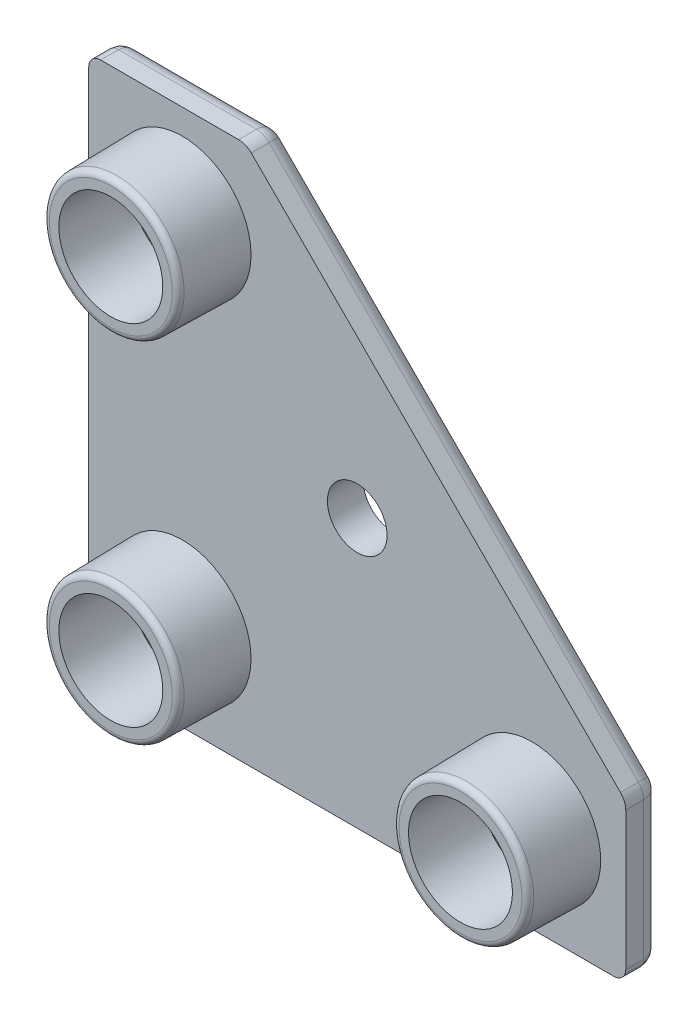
ISO-10303-21;
HEADER;
FILE_DESCRIPTION(('STEP AP214'),'2;1');
FILE_NAME('part.step','',(''),(''),'','','');
FILE_SCHEMA(('AUTOMOTIVE_DESIGN { 1 0 10303 214 1 1 1 1 }'));
ENDSEC;
DATA;
#1=APPLICATION_CONTEXT('core data for automotive mechanical design processes');
#2=APPLICATION_PROTOCOL_DEFINITION('international standard','automotive_design',2000,#1);
#3=PRODUCT_CONTEXT('',#1,'mechanical');
#4=PRODUCT('Part','Part','',(#3));
#5=PRODUCT_RELATED_PRODUCT_CATEGORY('part','',(#4));
#6=PRODUCT_DEFINITION_FORMATION('','',#4);
#7=PRODUCT_DEFINITION_CONTEXT('part definition',#1,'design');
#8=PRODUCT_DEFINITION('design','',#6,#7);
#9=PRODUCT_DEFINITION_SHAPE('','',#8);
#10=(LENGTH_UNIT() NAMED_UNIT(*) SI_UNIT(.MILLI.,.METRE.));
#11=(NAMED_UNIT(*) PLANE_ANGLE_UNIT() SI_UNIT($,.RADIAN.));
#12=(NAMED_UNIT(*) SI_UNIT($,.STERADIAN.) SOLID_ANGLE_UNIT());
#13=UNCERTAINTY_MEASURE_WITH_UNIT(LENGTH_MEASURE(1.E-05),#10,'distance_accuracy_value','');
#14=(GEOMETRIC_REPRESENTATION_CONTEXT(3) GLOBAL_UNCERTAINTY_ASSIGNED_CONTEXT((#13)) GLOBAL_UNIT_ASSIGNED_CONTEXT((#10,
#11,#12)) REPRESENTATION_CONTEXT('',''));
#15=CARTESIAN_POINT('',(0.,0.,0.));
#16=DIRECTION('',(0.,0.,1.));
#17=DIRECTION('',(1.,0.,0.));
#18=AXIS2_PLACEMENT_3D('',#15,#16,#17);
#19=CARTESIAN_POINT('',(-3.89867941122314,-3.89867941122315,3.));
#20=DIRECTION('',(0.,0.,1.));
#21=DIRECTION('',(1.,0.,0.));
#22=AXIS2_PLACEMENT_3D('',#19,#20,#21);
#23=PLANE('',#22);
#24=CARTESIAN_POINT('',(14.65,-14.65,2.9999999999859));
#25=DIRECTION('',(0.,0.,1.));
#26=DIRECTION('',(1.,0.,0.));
#27=AXIS2_PLACEMENT_3D('',#24,#25,#26);
#28=CIRCLE('',#27,4.24999999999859);
#29=CARTESIAN_POINT('',(18.8999999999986,-14.65,2.9999999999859));
#30=VERTEX_POINT('',#29);
#31=EDGE_CURVE('E19',#30,#30,#28,.T.);
#32=ORIENTED_EDGE('',*,*,#31,.T.);
#33=EDGE_LOOP('',(#32));
#34=FACE_BOUND('',#33,.T.);
#35=ADVANCED_FACE('F15',(#34),#23,.T.);
#36=CARTESIAN_POINT('',(-3.89867941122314,-3.89867941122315,3.));
#37=DIRECTION('',(0.,0.,1.));
#38=DIRECTION('',(1.,0.,0.));
#39=AXIS2_PLACEMENT_3D('',#36,#37,#38);
#40=PLANE('',#39);
#41=CARTESIAN_POINT('',(-14.65,-14.65,2.9999999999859));
#42=DIRECTION('',(0.,0.,1.));
#43=DIRECTION('',(1.,0.,0.));
#44=AXIS2_PLACEMENT_3D('',#41,#42,#43);
#45=CIRCLE('',#44,4.24999999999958);
#46=CARTESIAN_POINT('',(-10.4000000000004,-14.65,2.9999999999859));
#47=VERTEX_POINT('',#46);
#48=EDGE_CURVE('E35',#47,#47,#45,.T.);
#49=ORIENTED_EDGE('',*,*,#48,.T.);
#50=EDGE_LOOP('',(#49));
#51=FACE_BOUND('',#50,.T.);
#52=ADVANCED_FACE('F532',(#51),#40,.T.);
#53=CARTESIAN_POINT('',(-3.89867941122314,-3.89867941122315,3.));
#54=DIRECTION('',(0.,0.,1.));
#55=DIRECTION('',(1.,0.,0.));
#56=AXIS2_PLACEMENT_3D('',#53,#54,#55);
#57=PLANE('',#56);
#58=CARTESIAN_POINT('',(-14.65,14.65,2.9999999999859));
#59=DIRECTION('',(0.,0.,1.));
#60=DIRECTION('',(1.,0.,0.));
#61=AXIS2_PLACEMENT_3D('',#58,#59,#60);
#62=CIRCLE('',#61,4.24999999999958);
#63=CARTESIAN_POINT('',(-10.4000000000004,14.65,2.9999999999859));
#64=VERTEX_POINT('',#63);
#65=EDGE_CURVE('E527',#64,#64,#62,.T.);
#66=ORIENTED_EDGE('',*,*,#65,.T.);
#67=EDGE_LOOP('',(#66));
#68=FACE_BOUND('',#67,.T.);
#69=ADVANCED_FACE('F537',(#68),#57,.T.);
#70=CARTESIAN_POINT('',(14.65,-14.65,8.99999999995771));
#71=DIRECTION('',(0.,0.,1.));
#72=DIRECTION('',(1.,0.,0.));
#73=AXIS2_PLACEMENT_3D('',#70,#71,#72);
#74=CONICAL_SURFACE('',#73,4.35473038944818,0.0174532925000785);
#75=ORIENTED_EDGE('',*,*,#31,.F.);
#76=EDGE_LOOP('',(#75));
#77=FACE_BOUND('',#76,.T.);
#78=CARTESIAN_POINT('',(14.65,-14.65,9.00000000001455));
#79=DIRECTION('',(0.,0.,1.));
#80=DIRECTION('',(1.,0.,0.));
#81=AXIS2_PLACEMENT_3D('',#78,#79,#80);
#82=CIRCLE('',#81,4.35473038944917);
#83=CARTESIAN_POINT('',(19.0047303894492,-14.65,9.00000000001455));
#84=VERTEX_POINT('',#83);
#85=EDGE_CURVE('E520',#84,#84,#82,.T.);
#86=ORIENTED_EDGE('',*,*,#85,.T.);
#87=EDGE_LOOP('',(#86));
#88=FACE_BOUND('',#87,.T.);
#89=ADVANCED_FACE('F827',(#77,#88),#74,.F.);
#90=CARTESIAN_POINT('',(-14.65,-14.65,8.99999999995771));
#91=DIRECTION('',(0.,0.,1.));
#92=DIRECTION('',(1.,0.,0.));
#93=AXIS2_PLACEMENT_3D('',#90,#91,#92);
#94=CONICAL_SURFACE('',#93,4.35473038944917,0.0174532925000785);
#95=ORIENTED_EDGE('',*,*,#48,.F.);
#96=EDGE_LOOP('',(#95));
#97=FACE_BOUND('',#96,.T.);
#98=CARTESIAN_POINT('',(-14.65,-14.65,9.00000000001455));
#99=DIRECTION('',(0.,0.,1.));
#100=DIRECTION('',(1.,0.,0.));
#101=AXIS2_PLACEMENT_3D('',#98,#99,#100);
#102=CIRCLE('',#101,4.35473038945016);
#103=CARTESIAN_POINT('',(-10.2952696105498,-14.65,9.00000000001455));
#104=VERTEX_POINT('',#103);
#105=EDGE_CURVE('E516',#104,#104,#102,.T.);
#106=ORIENTED_EDGE('',*,*,#105,.T.);
#107=EDGE_LOOP('',(#106));
#108=FACE_BOUND('',#107,.T.);
#109=ADVANCED_FACE('F819',(#97,#108),#94,.F.);
#110=CARTESIAN_POINT('',(-14.65,14.65,8.99999999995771));
#111=DIRECTION('',(0.,0.,1.));
#112=DIRECTION('',(1.,0.,0.));
#113=AXIS2_PLACEMENT_3D('',#110,#111,#112);
#114=CONICAL_SURFACE('',#113,4.35473038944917,0.0174532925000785);
#115=ORIENTED_EDGE('',*,*,#65,.F.);
#116=EDGE_LOOP('',(#115));
#117=FACE_BOUND('',#116,.T.);
#118=CARTESIAN_POINT('',(-14.65,14.65,9.00000000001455));
#119=DIRECTION('',(0.,0.,1.));
#120=DIRECTION('',(1.,0.,0.));
#121=AXIS2_PLACEMENT_3D('',#118,#119,#120);
#122=CIRCLE('',#121,4.35473038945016);
#123=CARTESIAN_POINT('',(-10.2952696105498,14.65,9.00000000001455));
#124=VERTEX_POINT('',#123);
#125=EDGE_CURVE('E511',#124,#124,#122,.T.);
#126=ORIENTED_EDGE('',*,*,#125,.T.);
#127=EDGE_LOOP('',(#126));
#128=FACE_BOUND('',#127,.T.);
#129=ADVANCED_FACE('F811',(#117,#128),#114,.F.);
#130=CARTESIAN_POINT('',(14.65,-14.65,9.));
#131=DIRECTION('',(0.,0.,-1.));
#132=DIRECTION('',(-1.,0.,0.));
#133=AXIS2_PLACEMENT_3D('',#130,#131,#132);
#134=PLANE('',#133);
#135=ORIENTED_EDGE('',*,*,#85,.F.);
#136=EDGE_LOOP('',(#135));
#137=FACE_BOUND('',#136,.T.);
#138=CARTESIAN_POINT('',(14.65,-14.65,9.));
#139=DIRECTION('',(0.,0.,-1.));
#140=DIRECTION('',(1.,0.,0.));
#141=AXIS2_PLACEMENT_3D('',#138,#139,#140);
#142=CIRCLE('',#141,5.15392097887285);
#143=CARTESIAN_POINT('',(19.8039209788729,-14.65,9.));
#144=VERTEX_POINT('',#143);
#145=EDGE_CURVE('E505',#144,#144,#142,.T.);
#146=ORIENTED_EDGE('',*,*,#145,.F.);
#147=EDGE_LOOP('',(#146));
#148=FACE_BOUND('',#147,.T.);
#149=ADVANCED_FACE('F803',(#137,#148),#134,.F.);
#150=CARTESIAN_POINT('',(-14.65,-14.65,9.));
#151=DIRECTION('',(0.,0.,-1.));
#152=DIRECTION('',(-1.,0.,0.));
#153=AXIS2_PLACEMENT_3D('',#150,#151,#152);
#154=PLANE('',#153);
#155=ORIENTED_EDGE('',*,*,#105,.F.);
#156=EDGE_LOOP('',(#155));
#157=FACE_BOUND('',#156,.T.);
#158=CARTESIAN_POINT('',(-14.65,-14.65,9.));
#159=DIRECTION('',(0.,0.,-1.));
#160=DIRECTION('',(1.,0.,0.));
#161=AXIS2_PLACEMENT_3D('',#158,#159,#160);
#162=CIRCLE('',#161,5.15392097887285);
#163=CARTESIAN_POINT('',(-9.49607902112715,-14.65,9.));
#164=VERTEX_POINT('',#163);
#165=EDGE_CURVE('E500',#164,#164,#162,.T.);
#166=ORIENTED_EDGE('',*,*,#165,.F.);
#167=EDGE_LOOP('',(#166));
#168=FACE_BOUND('',#167,.T.);
#169=ADVANCED_FACE('F795',(#157,#168),#154,.F.);
#170=CARTESIAN_POINT('',(-14.65,14.65,9.));
#171=DIRECTION('',(0.,0.,-1.));
#172=DIRECTION('',(-1.,0.,0.));
#173=AXIS2_PLACEMENT_3D('',#170,#171,#172);
#174=PLANE('',#173);
#175=ORIENTED_EDGE('',*,*,#125,.F.);
#176=EDGE_LOOP('',(#175));
#177=FACE_BOUND('',#176,.T.);
#178=CARTESIAN_POINT('',(-14.65,14.65,9.));
#179=DIRECTION('',(0.,0.,-1.));
#180=DIRECTION('',(1.,0.,0.));
#181=AXIS2_PLACEMENT_3D('',#178,#179,#180);
#182=CIRCLE('',#181,5.15392097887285);
#183=CARTESIAN_POINT('',(-9.49607902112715,14.65,9.));
#184=VERTEX_POINT('',#183);
#185=EDGE_CURVE('E490',#184,#184,#182,.T.);
#186=ORIENTED_EDGE('',*,*,#185,.F.);
#187=EDGE_LOOP('',(#186));
#188=FACE_BOUND('',#187,.T.);
#189=ADVANCED_FACE('F787',(#177,#188),#174,.F.);
#190=CARTESIAN_POINT('',(14.65,-14.65,8.5));
#191=DIRECTION('',(0.,0.,-1.));
#192=DIRECTION('',(-1.,0.,0.));
#193=AXIS2_PLACEMENT_3D('',#190,#191,#192);
#194=TOROIDAL_SURFACE('',#193,5.15392097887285,0.5);
#195=CARTESIAN_POINT('',(14.65,-14.65,8.50872620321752));
#196=DIRECTION('',(0.,0.,-1.));
#197=DIRECTION('',(-1.,0.,0.));
#198=AXIS2_PLACEMENT_3D('',#195,#196,#197);
#199=CIRCLE('',#198,5.65384482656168);
#200=CARTESIAN_POINT('',(20.3038448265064,-14.65,8.50872620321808));
#201=VERTEX_POINT('',#200);
#202=EDGE_CURVE('E486',#201,#201,#199,.T.);
#203=ORIENTED_EDGE('',*,*,#202,.F.);
#204=EDGE_LOOP('',(#203));
#205=FACE_BOUND('',#204,.T.);
#206=ORIENTED_EDGE('',*,*,#145,.T.);
#207=EDGE_LOOP('',(#206));
#208=FACE_BOUND('',#207,.T.);
#209=ADVANCED_FACE('F779',(#205,#208),#194,.T.);
#210=CARTESIAN_POINT('',(-14.65,-14.65,8.5));
#211=DIRECTION('',(0.,0.,-1.));
#212=DIRECTION('',(-1.,0.,0.));
#213=AXIS2_PLACEMENT_3D('',#210,#211,#212);
#214=TOROIDAL_SURFACE('',#213,5.15392097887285,0.5);
#215=CARTESIAN_POINT('',(-14.65,-14.65,8.50872620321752));
#216=DIRECTION('',(0.,0.,-1.));
#217=DIRECTION('',(-1.,0.,0.));
#218=AXIS2_PLACEMENT_3D('',#215,#216,#217);
#219=CIRCLE('',#218,5.65384482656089);
#220=CARTESIAN_POINT('',(-8.99615517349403,-14.65,8.50872620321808));
#221=VERTEX_POINT('',#220);
#222=EDGE_CURVE('E481',#221,#221,#219,.T.);
#223=ORIENTED_EDGE('',*,*,#222,.F.);
#224=EDGE_LOOP('',(#223));
#225=FACE_BOUND('',#224,.T.);
#226=ORIENTED_EDGE('',*,*,#165,.T.);
#227=EDGE_LOOP('',(#226));
#228=FACE_BOUND('',#227,.T.);
#229=ADVANCED_FACE('F771',(#225,#228),#214,.T.);
#230=CARTESIAN_POINT('',(-14.65,14.65,8.5));
#231=DIRECTION('',(0.,0.,-1.));
#232=DIRECTION('',(-1.,0.,0.));
#233=AXIS2_PLACEMENT_3D('',#230,#231,#232);
#234=TOROIDAL_SURFACE('',#233,5.15392097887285,0.5);
#235=CARTESIAN_POINT('',(-14.65,14.65,8.50872620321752));
#236=DIRECTION('',(0.,0.,-1.));
#237=DIRECTION('',(-1.,0.,0.));
#238=AXIS2_PLACEMENT_3D('',#235,#236,#237);
#239=CIRCLE('',#238,5.65384482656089);
#240=CARTESIAN_POINT('',(-8.99615517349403,14.65,8.50872620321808));
#241=VERTEX_POINT('',#240);
#242=EDGE_CURVE('E470',#241,#241,#239,.T.);
#243=ORIENTED_EDGE('',*,*,#242,.F.);
#244=EDGE_LOOP('',(#243));
#245=FACE_BOUND('',#244,.T.);
#246=ORIENTED_EDGE('',*,*,#185,.T.);
#247=EDGE_LOOP('',(#246));
#248=FACE_BOUND('',#247,.T.);
#249=ADVANCED_FACE('F764',(#245,#248),#234,.T.);
#250=CARTESIAN_POINT('',(-9.94132034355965,21.,0.));
#251=DIRECTION('',(0.,0.,1.));
#252=DIRECTION('',(1.,0.,0.));
#253=AXIS2_PLACEMENT_3D('',#250,#251,#252);
#254=CYLINDRICAL_SURFACE('',#253,1.5);
#255=CARTESIAN_POINT('',(-9.94132034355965,21.,1.5));
#256=DIRECTION('',(0.,0.,1.));
#257=DIRECTION('',(1.,0.,0.));
#258=AXIS2_PLACEMENT_3D('',#255,#256,#257);
#259=CIRCLE('',#258,1.5);
#260=CARTESIAN_POINT('',(-9.94132034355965,22.5,1.5));
#261=VERTEX_POINT('',#260);
#262=CARTESIAN_POINT('',(-8.88066017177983,22.0606601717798,1.5));
#263=VERTEX_POINT('',#262);
#264=EDGE_CURVE('E344',#261,#263,#259,.F.);
#265=ORIENTED_EDGE('',*,*,#264,.F.);
#266=DIRECTION('',(0.,0.,1.));
#267=VECTOR('',#266,1.);
#268=CARTESIAN_POINT('',(-9.94132034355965,22.5,0.));
#269=LINE('',#268,#267);
#270=CARTESIAN_POINT('',(-9.94132034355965,22.5,3.));
#271=VERTEX_POINT('',#270);
#272=EDGE_CURVE('E466',#271,#261,#269,.F.);
#273=ORIENTED_EDGE('',*,*,#272,.F.);
#274=CARTESIAN_POINT('',(-9.94132034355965,21.,3.));
#275=DIRECTION('',(0.,0.,1.));
#276=DIRECTION('',(1.,0.,0.));
#277=AXIS2_PLACEMENT_3D('',#274,#275,#276);
#278=CIRCLE('',#277,1.5);
#279=CARTESIAN_POINT('',(-8.88066017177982,22.0606601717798,3.));
#280=VERTEX_POINT('',#279);
#281=EDGE_CURVE('E333',#280,#271,#278,.T.);
#282=ORIENTED_EDGE('',*,*,#281,.F.);
#283=DIRECTION('',(0.,0.,1.));
#284=VECTOR('',#283,1.);
#285=CARTESIAN_POINT('',(-8.88066017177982,22.0606601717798,0.));
#286=LINE('',#285,#284);
#287=EDGE_CURVE('E342',#263,#280,#286,.T.);
#288=ORIENTED_EDGE('',*,*,#287,.F.);
#289=EDGE_LOOP('',(#265,#273,#282,#288));
#290=FACE_BOUND('',#289,.T.);
#291=ADVANCED_FACE('F622',(#290),#254,.T.);
#292=CARTESIAN_POINT('',(-21.5,21.5,0.));
#293=DIRECTION('',(0.,0.,1.));
#294=DIRECTION('',(1.,0.,0.));
#295=AXIS2_PLACEMENT_3D('',#292,#293,#294);
#296=CYLINDRICAL_SURFACE('',#295,1.);
#297=CARTESIAN_POINT('',(-21.5,21.5,3.));
#298=DIRECTION('',(0.,0.,1.));
#299=DIRECTION('',(1.,0.,0.));
#300=AXIS2_PLACEMENT_3D('',#297,#298,#299);
#301=CIRCLE('',#300,1.);
#302=CARTESIAN_POINT('',(-21.5,22.5,3.));
#303=VERTEX_POINT('',#302);
#304=CARTESIAN_POINT('',(-22.5,21.5,3.));
#305=VERTEX_POINT('',#304);
#306=EDGE_CURVE('E609',#303,#305,#301,.T.);
#307=ORIENTED_EDGE('',*,*,#306,.F.);
#308=DIRECTION('',(0.,0.,1.));
#309=VECTOR('',#308,1.);
#310=CARTESIAN_POINT('',(-21.5,22.5,0.));
#311=LINE('',#310,#309);
#312=CARTESIAN_POINT('',(-21.5,22.5,1.5));
#313=VERTEX_POINT('',#312);
#314=EDGE_CURVE('E458',#313,#303,#311,.T.);
#315=ORIENTED_EDGE('',*,*,#314,.F.);
#316=CARTESIAN_POINT('',(-22.5,21.5,1.5));
#317=CARTESIAN_POINT('',(-22.5000000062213,21.5130898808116,1.5));
#318=CARTESIAN_POINT('',(-22.4997405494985,21.5261796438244,1.5));
#319=CARTESIAN_POINT('',(-22.4987061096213,21.5523387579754,1.5));
#320=CARTESIAN_POINT('',(-22.4979311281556,21.5654081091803,1.5));
#321=CARTESIAN_POINT('',(-22.4958690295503,21.5915064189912,1.5));
#322=CARTESIAN_POINT('',(-22.4945819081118,21.6045353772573,1.5));
#323=CARTESIAN_POINT('',(-22.4914989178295,21.6305330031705,1.5));
#324=CARTESIAN_POINT('',(-22.4897030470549,21.6435016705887,1.5));
#325=CARTESIAN_POINT('',(-22.4856059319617,21.669358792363,1.5));
#326=CARTESIAN_POINT('',(-22.4833046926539,21.6822472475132,1.5));
#327=CARTESIAN_POINT('',(-22.4782002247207,21.7079240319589,1.5));
#328=CARTESIAN_POINT('',(-22.4753970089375,21.7207123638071,1.5));
#329=CARTESIAN_POINT('',(-22.4692919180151,21.746168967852,1.5));
#330=CARTESIAN_POINT('',(-22.4659900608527,21.7588372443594,1.5));
#331=CARTESIAN_POINT('',(-22.4588912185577,21.7840338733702,1.5));
#332=CARTESIAN_POINT('',(-22.4550942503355,21.7965622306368,1.5));
#333=CARTESIAN_POINT('',(-22.447007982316,21.8214588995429,1.5));
#334=CARTESIAN_POINT('',(-22.442718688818,21.8338272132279,1.5));
#335=CARTESIAN_POINT('',(-22.4336539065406,21.8583846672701,1.5));
#336=CARTESIAN_POINT('',(-22.4288784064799,21.8705738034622,1.5));
#337=CARTESIAN_POINT('',(-22.418851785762,21.8947554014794,1.5));
#338=CARTESIAN_POINT('',(-22.4136006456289,21.9067478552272,1.5));
#339=CARTESIAN_POINT('',(-22.4026324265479,21.9305182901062,1.5));
#340=CARTESIAN_POINT('',(-22.396915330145,21.9422962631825,1.5));
#341=CARTESIAN_POINT('',(-22.3850251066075,21.9656200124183,1.5));
#342=CARTESIAN_POINT('',(-22.3788519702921,21.9771657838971,1.5));
#343=CARTESIAN_POINT('',(-22.3660595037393,22.0000073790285,1.5));
#344=CARTESIAN_POINT('',(-22.3594401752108,22.0113032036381,1.5));
#345=CARTESIAN_POINT('',(-22.3457651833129,22.0336271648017,1.5));
#346=CARTESIAN_POINT('',(-22.3387095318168,22.0446553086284,1.5));
#347=CARTESIAN_POINT('',(-22.3241717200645,22.066426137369,1.5));
#348=CARTESIAN_POINT('',(-22.3166895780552,22.0771688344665,1.5));
#349=CARTESIAN_POINT('',(-22.3013087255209,22.0983511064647,1.5));
#350=CARTESIAN_POINT('',(-22.2934100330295,22.1087906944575,1.5));
#351=CARTESIAN_POINT('',(-22.2772056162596,22.1293486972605,1.5));
#352=CARTESIAN_POINT('',(-22.2688999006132,22.1394671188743,1.5));
#353=CARTESIAN_POINT('',(-22.2518957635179,22.1593686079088,1.5));
#354=CARTESIAN_POINT('',(-22.243197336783,22.1691516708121,1.5));
#355=CARTESIAN_POINT('',(-22.2254227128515,22.1883689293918,1.5));
#356=CARTESIAN_POINT('',(-22.2163465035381,22.1978031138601,1.5));
#357=CARTESIAN_POINT('',(-22.1978310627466,22.2163089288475,1.5));
#358=CARTESIAN_POINT('',(-22.1883918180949,22.2253805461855,1.5));
#359=CARTESIAN_POINT('',(-22.1691651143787,22.2431475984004,1.5));
#360=CARTESIAN_POINT('',(-22.1593776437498,22.2518430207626,1.5));
#361=CARTESIAN_POINT('',(-22.1394692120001,22.2688439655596,1.5));
#362=CARTESIAN_POINT('',(-22.1293482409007,22.2771494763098,1.5));
#363=CARTESIAN_POINT('',(-22.108787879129,22.2933571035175,1.5));
#364=CARTESIAN_POINT('',(-22.0983484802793,22.3012592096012,1.5));
#365=CARTESIAN_POINT('',(-22.0771681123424,22.3166484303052,1.5));
#366=CARTESIAN_POINT('',(-22.066427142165,22.3241355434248,1.5));
#367=CARTESIAN_POINT('',(-22.0446603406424,22.3386829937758,1.5));
#368=CARTESIAN_POINT('',(-22.0336345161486,22.3457433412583,1.5));
#369=CARTESIAN_POINT('',(-22.0113147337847,22.3594254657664,1.5));
#370=CARTESIAN_POINT('',(-22.0000207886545,22.3660472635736,1.5));
#371=CARTESIAN_POINT('',(-21.9771815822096,22.3788406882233,1.5));
#372=CARTESIAN_POINT('',(-21.965636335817,22.385012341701,1.5));
#373=CARTESIAN_POINT('',(-21.9423109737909,22.3968931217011,1.5));
#374=CARTESIAN_POINT('',(-21.9305308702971,22.4026022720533,1.5));
#375=CARTESIAN_POINT('',(-21.9067538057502,22.4135491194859,1.5));
#376=CARTESIAN_POINT('',(-21.8947568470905,22.4187868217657,1.5));
#377=CARTESIAN_POINT('',(-21.8705659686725,22.4287866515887,1.5));
#378=CARTESIAN_POINT('',(-21.8583720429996,22.4335487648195,1.5));
#379=CARTESIAN_POINT('',(-21.8338066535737,22.4425923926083,1.5));
#380=CARTESIAN_POINT('',(-21.8214351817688,22.4468738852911,1.5));
#381=CARTESIAN_POINT('',(-21.7965342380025,22.4549514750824,1.5));
#382=CARTESIAN_POINT('',(-21.7840047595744,22.4587475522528,1.5));
#383=CARTESIAN_POINT('',(-21.7588073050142,22.4658494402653,1.5));
#384=CARTESIAN_POINT('',(-21.7461393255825,22.4691552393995,1.5));
#385=CARTESIAN_POINT('',(-21.7206843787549,22.475271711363,1.5));
#386=CARTESIAN_POINT('',(-21.707897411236,22.4780823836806,1.5));
#387=CARTESIAN_POINT('',(-21.6822239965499,22.4832037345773,1.5));
#388=CARTESIAN_POINT('',(-21.6693375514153,22.4855144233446,1.5));
#389=CARTESIAN_POINT('',(-21.6434846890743,22.489630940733,1.5));
#390=CARTESIAN_POINT('',(-21.6305182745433,22.4914367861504,1.5));
#391=CARTESIAN_POINT('',(-21.6045249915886,22.4945387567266,1.5));
#392=CARTESIAN_POINT('',(-21.5914981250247,22.4958348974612,1.5));
#393=CARTESIAN_POINT('',(-21.5654034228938,22.4979125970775,1.5));
#394=CARTESIAN_POINT('',(-21.5523355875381,22.4986941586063,1.5));
#395=CARTESIAN_POINT('',(-21.5261785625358,22.4997378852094,1.5));
#396=CARTESIAN_POINT('',(-21.5130893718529,22.5000000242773,1.5));
#397=CARTESIAN_POINT('',(-21.5,22.5,1.5));
#398=B_SPLINE_CURVE_WITH_KNOTS('',3,(#316,#317,#318,#319,#320,#321,#322,#323,#324,#325,#326,
#327,#328,#329,#330,#331,#332,#333,#334,#335,#336,#337,#338,#339,#340,#341,#342,#343,#344,#345,
#346,#347,#348,#349,#350,#351,#352,#353,#354,#355,#356,#357,#358,#359,#360,#361,#362,#363,#364,
#365,#366,#367,#368,#369,#370,#371,#372,#373,#374,#375,#376,#377,#378,#379,#380,#381,#382,#383,
#384,#385,#386,#387,#388,#389,#390,#391,#392,#393,#394,#395,#396,#397),.UNSPECIFIED.,.F.,.F.,(4,
2,2,2,2,2,2,2,2,2,2,2,2,2,2,2,2,2,2,2,2,2,2,2,2,2,2,2,2,2,2,2,2,2,2,2,2,2,2,2,4),(0.,
0.0392669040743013,0.0785336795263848,0.1178007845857,0.1570680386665,0.196334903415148,
0.235600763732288,0.274865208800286,0.314128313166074,0.353390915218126,0.392654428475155,
0.431919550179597,0.47118614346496,0.51045352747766,0.549720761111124,0.588986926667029,
0.628251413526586,0.667514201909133,0.706776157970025,0.746038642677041,0.785302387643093,
0.824567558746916,0.86383403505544,0.903101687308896,0.942370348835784,0.981639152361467,
1.02090701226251,1.06017301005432,1.09943668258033,1.13869833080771,1.17795954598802,
1.21722194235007,1.25648612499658,1.29575191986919,1.3350186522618,1.37428542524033,
1.41355139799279,1.45281606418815,1.49207953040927,1.53134279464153,1.57060802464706),.UNSPECIFIED.);
#399=CARTESIAN_POINT('',(-22.5,21.5000000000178,1.5));
#400=VERTEX_POINT('',#399);
#401=EDGE_CURVE('E465',#400,#313,#398,.T.);
#402=ORIENTED_EDGE('',*,*,#401,.F.);
#403=DIRECTION('',(0.,0.,1.));
#404=VECTOR('',#403,1.);
#405=CARTESIAN_POINT('',(-22.5,21.5,0.));
#406=LINE('',#405,#404);
#407=EDGE_CURVE('E628',#305,#400,#406,.F.);
#408=ORIENTED_EDGE('',*,*,#407,.F.);
#409=EDGE_LOOP('',(#307,#315,#402,#408));
#410=FACE_BOUND('',#409,.T.);
#411=ADVANCED_FACE('F626',(#410),#296,.T.);
#412=CARTESIAN_POINT('',(-21.5,-21.5,0.));
#413=DIRECTION('',(0.,0.,1.));
#414=DIRECTION('',(1.,0.,0.));
#415=AXIS2_PLACEMENT_3D('',#412,#413,#414);
#416=CYLINDRICAL_SURFACE('',#415,1.);
#417=CARTESIAN_POINT('',(-21.5,-21.5,3.));
#418=DIRECTION('',(0.,0.,1.));
#419=DIRECTION('',(1.,0.,0.));
#420=AXIS2_PLACEMENT_3D('',#417,#418,#419);
#421=CIRCLE('',#420,1.);
#422=CARTESIAN_POINT('',(-22.5,-21.5,3.));
#423=VERTEX_POINT('',#422);
#424=CARTESIAN_POINT('',(-21.5,-22.5,3.));
#425=VERTEX_POINT('',#424);
#426=EDGE_CURVE('E607',#423,#425,#421,.T.);
#427=ORIENTED_EDGE('',*,*,#426,.F.);
#428=DIRECTION('',(0.,0.,1.));
#429=VECTOR('',#428,1.);
#430=CARTESIAN_POINT('',(-22.5,-21.5,0.));
#431=LINE('',#430,#429);
#432=CARTESIAN_POINT('',(-22.5,-21.5,1.5));
#433=VERTEX_POINT('',#432);
#434=EDGE_CURVE('E631',#433,#423,#431,.T.);
#435=ORIENTED_EDGE('',*,*,#434,.F.);
#436=CARTESIAN_POINT('',(-21.5,-22.5,1.5));
#437=CARTESIAN_POINT('',(-21.6121997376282,-22.5,1.5));
#438=CARTESIAN_POINT('',(-21.8365639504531,-22.461876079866,1.5));
#439=CARTESIAN_POINT('',(-22.1021506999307,-22.3150634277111,1.5));
#440=CARTESIAN_POINT('',(-22.2883243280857,-22.1287012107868,1.5));
#441=CARTESIAN_POINT('',(-22.4486419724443,-21.8738200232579,1.5));
#442=CARTESIAN_POINT('',(-22.5,-21.649599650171,1.5));
#443=CARTESIAN_POINT('',(-22.5,-21.5,1.5));
#444=B_SPLINE_CURVE_WITH_KNOTS('',3,(#436,#437,#438,#439,#440,#441,#442,#443),.UNSPECIFIED.,.F.,
.F.,(4,1,1,1,1,4),(0.,0.214285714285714,0.428571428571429,0.571428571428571,0.714285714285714,
1.),.UNSPECIFIED.);
#445=CARTESIAN_POINT('',(-21.5000000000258,-22.5,1.5));
#446=VERTEX_POINT('',#445);
#447=EDGE_CURVE('E407',#446,#433,#444,.T.);
#448=ORIENTED_EDGE('',*,*,#447,.F.);
#449=DIRECTION('',(0.,0.,-1.));
#450=VECTOR('',#449,1.);
#451=CARTESIAN_POINT('',(-21.5,-22.5,0.));
#452=LINE('',#451,#450);
#453=EDGE_CURVE('E569',#425,#446,#452,.T.);
#454=ORIENTED_EDGE('',*,*,#453,.F.);
#455=EDGE_LOOP('',(#427,#435,#448,#454));
#456=FACE_BOUND('',#455,.T.);
#457=ADVANCED_FACE('F389',(#456),#416,.T.);
#458=CARTESIAN_POINT('',(21.5,-21.5,0.));
#459=DIRECTION('',(0.,0.,1.));
#460=DIRECTION('',(1.,0.,0.));
#461=AXIS2_PLACEMENT_3D('',#458,#459,#460);
#462=CYLINDRICAL_SURFACE('',#461,1.);
#463=CARTESIAN_POINT('',(21.5,-21.5,3.));
#464=DIRECTION('',(0.,0.,1.));
#465=DIRECTION('',(1.,0.,0.));
#466=AXIS2_PLACEMENT_3D('',#463,#464,#465);
#467=CIRCLE('',#466,1.);
#468=CARTESIAN_POINT('',(21.5,-22.5,3.));
#469=VERTEX_POINT('',#468);
#470=CARTESIAN_POINT('',(22.5,-21.5,3.));
#471=VERTEX_POINT('',#470);
#472=EDGE_CURVE('E585',#469,#471,#467,.T.);
#473=ORIENTED_EDGE('',*,*,#472,.F.);
#474=DIRECTION('',(0.,0.,-1.));
#475=VECTOR('',#474,1.);
#476=CARTESIAN_POINT('',(21.5,-22.5,0.));
#477=LINE('',#476,#475);
#478=CARTESIAN_POINT('',(21.5,-22.5,1.5));
#479=VERTEX_POINT('',#478);
#480=EDGE_CURVE('E639',#479,#469,#477,.F.);
#481=ORIENTED_EDGE('',*,*,#480,.F.);
#482=CARTESIAN_POINT('',(22.5,-21.5,1.5));
#483=CARTESIAN_POINT('',(22.5,-21.6121997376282,1.5));
#484=CARTESIAN_POINT('',(22.461876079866,-21.8365639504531,1.5));
#485=CARTESIAN_POINT('',(22.3150634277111,-22.1021506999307,1.5));
#486=CARTESIAN_POINT('',(22.1287012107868,-22.2883243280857,1.5));
#487=CARTESIAN_POINT('',(21.8738200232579,-22.4486419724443,1.5));
#488=CARTESIAN_POINT('',(21.649599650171,-22.5,1.5));
#489=CARTESIAN_POINT('',(21.5,-22.5,1.5));
#490=B_SPLINE_CURVE_WITH_KNOTS('',3,(#482,#483,#484,#485,#486,#487,#488,#489),.UNSPECIFIED.,.F.,
.F.,(4,1,1,1,1,4),(0.,0.214285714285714,0.428571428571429,0.571428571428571,0.714285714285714,
1.),.UNSPECIFIED.);
#491=CARTESIAN_POINT('',(22.5,-21.5000000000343,1.5));
#492=VERTEX_POINT('',#491);
#493=EDGE_CURVE('E184',#492,#479,#490,.T.);
#494=ORIENTED_EDGE('',*,*,#493,.F.);
#495=DIRECTION('',(0.,0.,-1.));
#496=VECTOR('',#495,1.);
#497=CARTESIAN_POINT('',(22.5,-21.5,0.));
#498=LINE('',#497,#496);
#499=EDGE_CURVE('E568',#471,#492,#498,.T.);
#500=ORIENTED_EDGE('',*,*,#499,.F.);
#501=EDGE_LOOP('',(#473,#481,#494,#500));
#502=FACE_BOUND('',#501,.T.);
#503=ADVANCED_FACE('F384',(#502),#462,.T.);
#504=CARTESIAN_POINT('',(21.,-9.94132034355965,0.));
#505=DIRECTION('',(0.,0.,1.));
#506=DIRECTION('',(1.,0.,0.));
#507=AXIS2_PLACEMENT_3D('',#504,#505,#506);
#508=CYLINDRICAL_SURFACE('',#507,1.5);
#509=CARTESIAN_POINT('',(21.,-9.94132034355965,1.5));
#510=DIRECTION('',(0.,0.,1.));
#511=DIRECTION('',(1.,0.,0.));
#512=AXIS2_PLACEMENT_3D('',#509,#510,#511);
#513=CIRCLE('',#512,1.5);
#514=CARTESIAN_POINT('',(22.0606601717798,-8.88066017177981,1.5));
#515=VERTEX_POINT('',#514);
#516=CARTESIAN_POINT('',(22.5,-9.94132034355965,1.5));
#517=VERTEX_POINT('',#516);
#518=EDGE_CURVE('E330',#515,#517,#513,.F.);
#519=ORIENTED_EDGE('',*,*,#518,.F.);
#520=DIRECTION('',(0.,0.,1.));
#521=VECTOR('',#520,1.);
#522=CARTESIAN_POINT('',(22.0606601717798,-8.8806601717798,0.));
#523=LINE('',#522,#521);
#524=CARTESIAN_POINT('',(22.0606601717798,-8.88066017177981,3.));
#525=VERTEX_POINT('',#524);
#526=EDGE_CURVE('E334',#525,#515,#523,.F.);
#527=ORIENTED_EDGE('',*,*,#526,.F.);
#528=CARTESIAN_POINT('',(21.,-9.94132034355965,3.));
#529=DIRECTION('',(0.,0.,1.));
#530=DIRECTION('',(1.,0.,0.));
#531=AXIS2_PLACEMENT_3D('',#528,#529,#530);
#532=CIRCLE('',#531,1.5);
#533=CARTESIAN_POINT('',(22.5,-9.94132034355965,3.));
#534=VERTEX_POINT('',#533);
#535=EDGE_CURVE('E564',#534,#525,#532,.T.);
#536=ORIENTED_EDGE('',*,*,#535,.F.);
#537=DIRECTION('',(0.,0.,-1.));
#538=VECTOR('',#537,1.);
#539=CARTESIAN_POINT('',(22.5,-9.94132034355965,0.));
#540=LINE('',#539,#538);
#541=EDGE_CURVE('E562',#517,#534,#540,.F.);
#542=ORIENTED_EDGE('',*,*,#541,.F.);
#543=EDGE_LOOP('',(#519,#527,#536,#542));
#544=FACE_BOUND('',#543,.T.);
#545=ADVANCED_FACE('F380',(#544),#508,.T.);
#546=CARTESIAN_POINT('',(14.65,-14.65,2.9999999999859));
#547=DIRECTION('',(0.,0.,-1.));
#548=DIRECTION('',(-1.,0.,0.));
#549=AXIS2_PLACEMENT_3D('',#546,#547,#548);
#550=CONICAL_SURFACE('',#549,5.74999999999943,0.0174532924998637);
#551=ORIENTED_EDGE('',*,*,#202,.T.);
#552=EDGE_LOOP('',(#551));
#553=FACE_BOUND('',#552,.T.);
#554=CARTESIAN_POINT('',(14.65,-14.65,2.9999999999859));
#555=DIRECTION('',(0.,0.,-1.));
#556=DIRECTION('',(-1.,0.,0.));
#557=AXIS2_PLACEMENT_3D('',#554,#555,#556);
#558=CIRCLE('',#557,5.74999999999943);
#559=CARTESIAN_POINT('',(20.3999999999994,-14.65,2.9999999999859));
#560=VERTEX_POINT('',#559);
#561=EDGE_CURVE('E591',#560,#560,#558,.T.);
#562=ORIENTED_EDGE('',*,*,#561,.F.);
#563=EDGE_LOOP('',(#562));
#564=FACE_BOUND('',#563,.T.);
#565=ADVANCED_FACE('F376',(#553,#564),#550,.T.);
#566=CARTESIAN_POINT('',(-14.65,-14.65,2.9999999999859));
#567=DIRECTION('',(0.,0.,-1.));
#568=DIRECTION('',(-1.,0.,0.));
#569=AXIS2_PLACEMENT_3D('',#566,#567,#568);
#570=CONICAL_SURFACE('',#569,5.74999999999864,0.0174532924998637);
#571=ORIENTED_EDGE('',*,*,#222,.T.);
#572=EDGE_LOOP('',(#571));
#573=FACE_BOUND('',#572,.T.);
#574=CARTESIAN_POINT('',(-14.65,-14.65,2.9999999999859));
#575=DIRECTION('',(0.,0.,-1.));
#576=DIRECTION('',(-1.,0.,0.));
#577=AXIS2_PLACEMENT_3D('',#574,#575,#576);
#578=CIRCLE('',#577,5.74999999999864);
#579=CARTESIAN_POINT('',(-8.90000000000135,-14.65,2.9999999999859));
#580=VERTEX_POINT('',#579);
#581=EDGE_CURVE('E602',#580,#580,#578,.T.);
#582=ORIENTED_EDGE('',*,*,#581,.F.);
#583=EDGE_LOOP('',(#582));
#584=FACE_BOUND('',#583,.T.);
#585=ADVANCED_FACE('F372',(#573,#584),#570,.T.);
#586=CARTESIAN_POINT('',(-14.65,14.65,2.9999999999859));
#587=DIRECTION('',(0.,0.,-1.));
#588=DIRECTION('',(-1.,0.,0.));
#589=AXIS2_PLACEMENT_3D('',#586,#587,#588);
#590=CONICAL_SURFACE('',#589,5.74999999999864,0.0174532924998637);
#591=ORIENTED_EDGE('',*,*,#242,.T.);
#592=EDGE_LOOP('',(#591));
#593=FACE_BOUND('',#592,.T.);
#594=CARTESIAN_POINT('',(-14.65,14.65,2.9999999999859));
#595=DIRECTION('',(0.,0.,-1.));
#596=DIRECTION('',(-1.,0.,0.));
#597=AXIS2_PLACEMENT_3D('',#594,#595,#596);
#598=CIRCLE('',#597,5.74999999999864);
#599=CARTESIAN_POINT('',(-8.90000000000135,14.65,2.9999999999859));
#600=VERTEX_POINT('',#599);
#601=EDGE_CURVE('E599',#600,#600,#598,.T.);
#602=ORIENTED_EDGE('',*,*,#601,.F.);
#603=EDGE_LOOP('',(#602));
#604=FACE_BOUND('',#603,.T.);
#605=ADVANCED_FACE('F368',(#593,#604),#590,.T.);
#606=CARTESIAN_POINT('',(-22.5,22.5,0.));
#607=DIRECTION('',(0.,1.,0.));
#608=DIRECTION('',(0.,0.,1.));
#609=AXIS2_PLACEMENT_3D('',#606,#607,#608);
#610=PLANE('',#609);
#611=ORIENTED_EDGE('',*,*,#314,.T.);
#612=DIRECTION('',(1.,0.,0.));
#613=VECTOR('',#612,1.);
#614=CARTESIAN_POINT('',(-3.89867941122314,22.5,3.));
#615=LINE('',#614,#613);
#616=EDGE_CURVE('E328',#271,#303,#615,.F.);
#617=ORIENTED_EDGE('',*,*,#616,.F.);
#618=ORIENTED_EDGE('',*,*,#272,.T.);
#619=DIRECTION('',(1.,0.,0.));
#620=VECTOR('',#619,1.);
#621=CARTESIAN_POINT('',(-13.1993397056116,22.5,1.5));
#622=LINE('',#621,#620);
#623=EDGE_CURVE('E303',#313,#261,#622,.T.);
#624=ORIENTED_EDGE('',*,*,#623,.F.);
#625=EDGE_LOOP('',(#611,#617,#618,#624));
#626=FACE_BOUND('',#625,.T.);
#627=ADVANCED_FACE('F365',(#626),#610,.T.);
#628=CARTESIAN_POINT('',(-21.5,22.5,1.5));
#629=CARTESIAN_POINT('',(-21.649599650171,22.5,1.5));
#630=CARTESIAN_POINT('',(-21.8738200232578,22.4486419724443,1.5));
#631=CARTESIAN_POINT('',(-22.1287012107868,22.2883243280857,1.5));
#632=CARTESIAN_POINT('',(-22.3150634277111,22.1021506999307,1.5));
#633=CARTESIAN_POINT('',(-22.461876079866,21.8365639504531,1.5));
#634=CARTESIAN_POINT('',(-22.5,21.6121997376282,1.5));
#635=CARTESIAN_POINT('',(-22.5,21.5,1.5));
#636=CARTESIAN_POINT('',(-21.5,22.5,1.3878002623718));
#637=CARTESIAN_POINT('',(-21.649599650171,22.5,1.37658410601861));
#638=CARTESIAN_POINT('',(-21.8738200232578,22.4486419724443,1.36367785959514));
#639=CARTESIAN_POINT('',(-22.1287012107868,22.2883243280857,1.35659921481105));
#640=CARTESIAN_POINT('',(-22.3150634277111,22.1021506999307,1.3565890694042));
#641=CARTESIAN_POINT('',(-22.461876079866,21.8365639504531,1.36547389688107));
#642=CARTESIAN_POINT('',(-22.5,21.6121997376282,1.37940644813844));
#643=CARTESIAN_POINT('',(-22.5,21.5,1.38780026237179));
#644=CARTESIAN_POINT('',(-21.4936678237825,22.4810034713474,1.21952263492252));
#645=CARTESIAN_POINT('',(-21.6388114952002,22.4769995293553,1.19182072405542));
#646=CARTESIAN_POINT('',(-21.8563548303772,22.4220136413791,1.15996565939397));
#647=CARTESIAN_POINT('',(-22.105124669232,22.2621117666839,1.14250951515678));
#648=CARTESIAN_POINT('',(-22.2883930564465,22.0790090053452,1.14248346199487));
#649=CARTESIAN_POINT('',(-22.4356076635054,21.8202009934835,1.16439442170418));
#650=CARTESIAN_POINT('',(-22.4779798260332,21.602520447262,1.19878388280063));
#651=CARTESIAN_POINT('',(-22.4810034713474,21.4936678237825,1.21952263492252));
#652=CARTESIAN_POINT('',(-21.4625698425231,22.3877095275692,0.895590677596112));
#653=CARTESIAN_POINT('',(-21.5887446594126,22.3682176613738,0.846187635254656));
#654=CARTESIAN_POINT('',(-21.7779362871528,22.3005035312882,0.789958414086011));
#655=CARTESIAN_POINT('',(-21.9999301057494,22.1445543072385,0.759263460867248));
#656=CARTESIAN_POINT('',(-22.1687470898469,21.9758542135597,0.759224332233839));
#657=CARTESIAN_POINT('',(-22.3152450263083,21.7464641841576,0.797730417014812));
#658=CARTESIAN_POINT('',(-22.3731290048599,21.5572131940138,0.85859879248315));
#659=CARTESIAN_POINT('',(-22.3877095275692,21.4625698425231,0.895590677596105));
#660=CARTESIAN_POINT('',(-21.3892696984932,22.1678090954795,0.496985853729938));
#661=CARTESIAN_POINT('',(-21.4789238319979,22.1235341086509,0.445954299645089));
#662=CARTESIAN_POINT('',(-21.6134381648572,22.0389518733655,0.389505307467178));
#663=CARTESIAN_POINT('',(-21.7810497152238,21.8980557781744,0.359035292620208));
#664=CARTESIAN_POINT('',(-21.9175921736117,21.7615503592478,0.359013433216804));
#665=CARTESIAN_POINT('',(-22.0546440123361,21.5910240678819,0.397176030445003));
#666=CARTESIAN_POINT('',(-22.1346789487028,21.4565319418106,0.458741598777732));
#667=CARTESIAN_POINT('',(-22.1678090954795,21.3892696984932,0.496985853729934));
#668=CARTESIAN_POINT('',(-21.2243681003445,21.6731043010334,0.10245434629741));
#669=CARTESIAN_POINT('',(-21.2669615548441,21.6301718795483,0.088463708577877));
#670=CARTESIAN_POINT('',(-21.3308859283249,21.5659469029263,0.073741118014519));
#671=CARTESIAN_POINT('',(-21.4162409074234,21.4803297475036,0.065954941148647));
#672=CARTESIAN_POINT('',(-21.4910280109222,21.405556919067,0.065957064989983));
#673=CARTESIAN_POINT('',(-21.5766653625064,21.320228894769,0.075679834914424));
#674=CARTESIAN_POINT('',(-21.6409664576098,21.2563289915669,0.091950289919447));
#675=CARTESIAN_POINT('',(-21.6731043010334,21.2243681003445,0.102454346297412));
#676=CARTESIAN_POINT('',(-21.0747998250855,21.2243994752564,0.));
#677=CARTESIAN_POINT('',(-21.089047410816,21.2101518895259,0.));
#678=CARTESIAN_POINT('',(-21.1104187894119,21.18878051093,0.));
#679=CARTESIAN_POINT('',(-21.138913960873,21.1602853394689,0.));
#680=CARTESIAN_POINT('',(-21.1638472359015,21.1353520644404,0.));
#681=CARTESIAN_POINT('',(-21.1923424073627,21.1068568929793,0.));
#682=CARTESIAN_POINT('',(-21.2137137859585,21.0854855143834,0.));
#683=CARTESIAN_POINT('',(-21.2243994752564,21.0747998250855,0.));
#684=CARTESIAN_POINT('',(-21.,21.,0.));
#685=CARTESIAN_POINT('',(-21.,21.,0.));
#686=CARTESIAN_POINT('',(-21.,21.,0.));
#687=CARTESIAN_POINT('',(-21.,21.,0.));
#688=CARTESIAN_POINT('',(-21.,21.,0.));
#689=CARTESIAN_POINT('',(-21.,21.,0.));
#690=CARTESIAN_POINT('',(-21.,21.,0.));
#691=CARTESIAN_POINT('',(-21.,21.,0.));
#692=B_SPLINE_SURFACE_WITH_KNOTS('',3,3,((#628,#629,#630,#631,#632,#633,#634,#635),(#636,#637,
#638,#639,#640,#641,#642,#643),(#644,#645,#646,#647,#648,#649,#650,#651),(#652,#653,#654,#655,
#656,#657,#658,#659),(#660,#661,#662,#663,#664,#665,#666,#667),(#668,#669,#670,#671,#672,#673,
#674,#675),(#676,#677,#678,#679,#680,#681,#682,#683),(#684,#685,#686,#687,#688,#689,#690,#691)),
.UNSPECIFIED.,.F.,.F.,.F.,(4,1,1,1,1,4),(4,1,1,1,1,4),(0.,0.224399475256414,0.336599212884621,
0.673198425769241,1.12199737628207,1.5707963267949),(0.,0.285714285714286,0.428571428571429,
0.571428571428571,0.785714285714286,1.),.UNSPECIFIED.);
#693=CARTESIAN_POINT('',(-21.,21.,0.));
#694=CARTESIAN_POINT('',(-21.2243994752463,21.0747998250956,0.));
#695=CARTESIAN_POINT('',(-21.6731043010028,21.2243681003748,0.102454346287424));
#696=CARTESIAN_POINT('',(-22.167809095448,21.3892696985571,0.496985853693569));
#697=CARTESIAN_POINT('',(-22.3877095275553,21.4625698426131,0.895590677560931));
#698=CARTESIAN_POINT('',(-22.4810034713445,21.493667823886,1.2195226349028));
#699=CARTESIAN_POINT('',(-22.5,21.5000000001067,1.38780026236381));
#700=CARTESIAN_POINT('',(-22.5,21.5000000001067,1.5));
#701=B_SPLINE_CURVE_WITH_KNOTS('',3,(#693,#694,#695,#696,#697,#698,#699,#700),.UNSPECIFIED.,.F.,
.F.,(4,1,1,1,1,4),(0.,0.448798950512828,0.897597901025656,1.23419711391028,1.34639685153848,
1.5707963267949),.UNSPECIFIED.);
#702=CARTESIAN_POINT('',(-21.,21.,0.));
#703=VERTEX_POINT('',#702);
#704=EDGE_CURVE('E263',#400,#703,#701,.F.);
#705=CARTESIAN_POINT('',(-21.5,22.5,1.5));
#706=CARTESIAN_POINT('',(-21.500000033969,22.500000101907,1.48036473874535));
#707=CARTESIAN_POINT('',(-21.4998707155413,22.499612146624,1.4607296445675));
#708=CARTESIAN_POINT('',(-21.4993548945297,22.4980646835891,1.42149025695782));
#709=CARTESIAN_POINT('',(-21.4989683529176,22.4969050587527,1.40188596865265));
#710=CARTESIAN_POINT('',(-21.4979394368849,22.4938183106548,1.3627381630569));
#711=CARTESIAN_POINT('',(-21.4972969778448,22.4918909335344,1.343194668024));
#712=CARTESIAN_POINT('',(-21.4957576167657,22.487272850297,1.30419829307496));
#713=CARTESIAN_POINT('',(-21.4948605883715,22.4845817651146,1.28474546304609));
#714=CARTESIAN_POINT('',(-21.4928134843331,22.4784404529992,1.24596026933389));
#715=CARTESIAN_POINT('',(-21.4916632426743,22.4749897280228,1.22662799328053));
#716=CARTESIAN_POINT('',(-21.4891110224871,22.4673330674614,1.18811379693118));
#717=CARTESIAN_POINT('',(-21.4877088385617,22.463126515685,1.16893201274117));
#718=CARTESIAN_POINT('',(-21.4846544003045,22.4539632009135,1.13074852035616));
#719=CARTESIAN_POINT('',(-21.4830019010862,22.4490057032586,1.11174700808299));
#720=CARTESIAN_POINT('',(-21.4794495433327,22.4383486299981,1.07395294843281));
#721=CARTESIAN_POINT('',(-21.4775494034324,22.4326482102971,1.05516066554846));
#722=CARTESIAN_POINT('',(-21.473504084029,22.420512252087,1.01781432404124));
#723=CARTESIAN_POINT('',(-21.4713585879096,22.4140757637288,0.999260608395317));
#724=CARTESIAN_POINT('',(-21.4668260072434,22.4004780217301,0.962419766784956));
#725=CARTESIAN_POINT('',(-21.4644385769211,22.3933157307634,0.944133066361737));
#726=CARTESIAN_POINT('',(-21.4594270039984,22.3782810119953,0.907853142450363));
#727=CARTESIAN_POINT('',(-21.4568024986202,22.3704074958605,0.889860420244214));
#728=CARTESIAN_POINT('',(-21.4513213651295,22.3539640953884,0.854195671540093));
#729=CARTESIAN_POINT('',(-21.448464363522,22.345393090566,0.836524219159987));
#730=CARTESIAN_POINT('',(-21.4425228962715,22.3275686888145,0.801529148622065));
#731=CARTESIAN_POINT('',(-21.4394380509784,22.3183141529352,0.784206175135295));
#732=CARTESIAN_POINT('',(-21.4330455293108,22.2991365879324,0.749935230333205));
#733=CARTESIAN_POINT('',(-21.4297374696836,22.2892124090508,0.732987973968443));
#734=CARTESIAN_POINT('',(-21.4229031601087,22.2687094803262,0.699495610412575));
#735=CARTESIAN_POINT('',(-21.4193765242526,22.2581295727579,0.682951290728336));
#736=CARTESIAN_POINT('',(-21.4121096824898,22.2363290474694,0.650292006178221));
#737=CARTESIAN_POINT('',(-21.4083690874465,22.2251072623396,0.6341779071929));
#738=CARTESIAN_POINT('',(-21.4006790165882,22.2020370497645,0.602406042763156));
#739=CARTESIAN_POINT('',(-21.3967291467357,22.1901874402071,0.5867492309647));
#740=CARTESIAN_POINT('',(-21.3886249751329,22.1658749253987,0.555919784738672));
#741=CARTESIAN_POINT('',(-21.3844702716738,22.1534108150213,0.540748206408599));
#742=CARTESIAN_POINT('',(-21.3759640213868,22.1278920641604,0.510909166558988));
#743=CARTESIAN_POINT('',(-21.37161207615,22.11483622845,0.49624284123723));
#744=CARTESIAN_POINT('',(-21.3627193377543,22.0881580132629,0.467432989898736));
#745=CARTESIAN_POINT('',(-21.3581781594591,22.0745344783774,0.453290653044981));
#746=CARTESIAN_POINT('',(-21.3489148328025,22.0467444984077,0.425547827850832));
#747=CARTESIAN_POINT('',(-21.3441923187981,22.0325769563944,0.41194856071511));
#748=CARTESIAN_POINT('',(-21.3345742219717,22.003722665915,0.385310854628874));
#749=CARTESIAN_POINT('',(-21.3296782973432,21.9890348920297,0.372273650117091));
#750=CARTESIAN_POINT('',(-21.3197212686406,21.9591638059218,0.346779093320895));
#751=CARTESIAN_POINT('',(-21.3146598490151,21.9439795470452,0.334322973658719));
#752=CARTESIAN_POINT('',(-21.3043797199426,21.9131391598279,0.31000961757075));
#753=CARTESIAN_POINT('',(-21.2991607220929,21.8974821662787,0.298153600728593));
#754=CARTESIAN_POINT('',(-21.2885733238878,21.8657199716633,0.275059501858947));
#755=CARTESIAN_POINT('',(-21.2832046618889,21.8496139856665,0.263822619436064));
#756=CARTESIAN_POINT('',(-21.2723258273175,21.8169774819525,0.241985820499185));
#757=CARTESIAN_POINT('',(-21.2668154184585,21.8004462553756,0.231387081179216));
#758=CARTESIAN_POINT('',(-21.2556609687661,21.7669829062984,0.210845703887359));
#759=CARTESIAN_POINT('',(-21.2500167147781,21.7500501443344,0.200904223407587));
#760=CARTESIAN_POINT('',(-21.2386025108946,21.7158075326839,0.181696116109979));
#761=CARTESIAN_POINT('',(-21.2328323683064,21.6984971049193,0.172430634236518));
#762=CARTESIAN_POINT('',(-21.2211741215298,21.6635223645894,0.154594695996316));
#763=CARTESIAN_POINT('',(-21.2152858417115,21.6458575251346,0.146025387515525));
#764=CARTESIAN_POINT('',(-21.2034001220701,21.6102003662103,0.129595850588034));
#765=CARTESIAN_POINT('',(-21.1974025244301,21.5922075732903,0.121736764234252));
#766=CARTESIAN_POINT('',(-21.1853082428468,21.5559247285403,0.106733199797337));
#767=CARTESIAN_POINT('',(-21.1792114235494,21.5376342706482,0.0995898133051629));
#768=CARTESIAN_POINT('',(-21.1669285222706,21.5007855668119,0.0860248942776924));
#769=CARTESIAN_POINT('',(-21.1607423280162,21.4822269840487,0.0796043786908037));
#770=CARTESIAN_POINT('',(-21.1482905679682,21.4448717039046,0.0674920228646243));
#771=CARTESIAN_POINT('',(-21.1420249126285,21.4260747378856,0.061801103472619));
#772=CARTESIAN_POINT('',(-21.1294241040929,21.3882723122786,0.0511549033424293));
#773=CARTESIAN_POINT('',(-21.1230888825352,21.3692666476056,0.0462004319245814));
#774=CARTESIAN_POINT('',(-21.1103588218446,21.3310764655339,0.0370340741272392));
#775=CARTESIAN_POINT('',(-21.1039639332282,21.3118917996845,0.0328228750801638));
#776=CARTESIAN_POINT('',(-21.0911244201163,21.2733732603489,0.0251500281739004));
#777=CARTESIAN_POINT('',(-21.0846797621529,21.2540392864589,0.0216889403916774));
#778=CARTESIAN_POINT('',(-21.0717505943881,21.2152517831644,0.0155232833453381));
#779=CARTESIAN_POINT('',(-21.0652660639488,21.1957981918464,0.0128191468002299));
#780=CARTESIAN_POINT('',(-21.0522670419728,21.1568011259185,0.00817436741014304));
#781=CARTESIAN_POINT('',(-21.0457525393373,21.1372576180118,0.00623403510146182));
#782=CARTESIAN_POINT('',(-21.0327034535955,21.0981103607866,0.00312380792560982));
#783=CARTESIAN_POINT('',(-21.0261688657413,21.0785065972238,0.00195411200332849));
#784=CARTESIAN_POINT('',(-21.0130895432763,21.0392686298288,0.000392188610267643));
#785=CARTESIAN_POINT('',(-21.0065448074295,21.0196344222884,6.47565137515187E-08));
#786=CARTESIAN_POINT('',(-21.,21.,0.));
#787=B_SPLINE_CURVE_WITH_KNOTS('',3,(#705,#706,#707,#708,#709,#710,#711,#712,#713,#714,#715,
#716,#717,#718,#719,#720,#721,#722,#723,#724,#725,#726,#727,#728,#729,#730,#731,#732,#733,#734,
#735,#736,#737,#738,#739,#740,#741,#742,#743,#744,#745,#746,#747,#748,#749,#750,#751,#752,#753,
#754,#755,#756,#757,#758,#759,#760,#761,#762,#763,#764,#765,#766,#767,#768,#769,#770,#771,#772,
#773,#774,#775,#776,#777,#778,#779,#780,#781,#782,#783,#784,#785,#786),.UNSPECIFIED.,.F.,.F.,(4,
2,2,2,2,2,2,2,2,2,2,2,2,2,2,2,2,2,2,2,2,2,2,2,2,2,2,2,2,2,2,2,2,2,2,2,2,2,2,2,4),(0.,
0.0589012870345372,0.117811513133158,0.176741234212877,0.235700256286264,0.29469804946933,
0.353744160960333,0.412848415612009,0.472020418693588,0.531269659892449,0.590604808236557,
0.650032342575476,0.709557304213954,0.769183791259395,0.828915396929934,0.888755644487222,
0.948708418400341,1.00877839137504,1.06897125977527,1.12929166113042,1.18974147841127,
1.25032034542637,1.31102610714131,1.37185527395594,1.43280347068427,1.49386588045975,
1.5550376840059,1.61631449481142,1.67769279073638,1.73917031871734,1.80074501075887,
1.86241223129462,1.92416515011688,1.98599525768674,2.04789281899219,2.10984732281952,
2.17184792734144,2.23388390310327,2.29594507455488,2.35802226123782,2.42010771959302),.UNSPECIFIED.);
#788=EDGE_CURVE('E298',#703,#313,#787,.F.);
#789=ORIENTED_EDGE('',*,*,#704,.F.);
#790=ORIENTED_EDGE('',*,*,#401,.T.);
#791=ORIENTED_EDGE('',*,*,#788,.F.);
#792=EDGE_LOOP('',(#789,#790,#791));
#793=FACE_BOUND('',#792,.T.);
#794=ADVANCED_FACE('F363',(#793),#692,.T.);
#795=CARTESIAN_POINT('',(-22.5,-22.5,0.));
#796=DIRECTION('',(-1.,0.,0.));
#797=DIRECTION('',(0.,0.,1.));
#798=AXIS2_PLACEMENT_3D('',#795,#796,#797);
#799=PLANE('',#798);
#800=DIRECTION('',(0.,1.,0.));
#801=VECTOR('',#800,1.);
#802=CARTESIAN_POINT('',(-22.5,-3.89867941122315,3.));
#803=LINE('',#802,#801);
#804=EDGE_CURVE('E608',#305,#423,#803,.F.);
#805=ORIENTED_EDGE('',*,*,#804,.F.);
#806=ORIENTED_EDGE('',*,*,#407,.T.);
#807=DIRECTION('',(0.,1.,0.));
#808=VECTOR('',#807,1.);
#809=CARTESIAN_POINT('',(-22.5,-13.1993397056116,1.5));
#810=LINE('',#809,#808);
#811=EDGE_CURVE('E280',#433,#400,#810,.T.);
#812=ORIENTED_EDGE('',*,*,#811,.F.);
#813=ORIENTED_EDGE('',*,*,#434,.T.);
#814=EDGE_LOOP('',(#805,#806,#812,#813));
#815=FACE_BOUND('',#814,.T.);
#816=ADVANCED_FACE('F360',(#815),#799,.T.);
#817=CARTESIAN_POINT('',(-22.5,-21.5,1.5));
#818=CARTESIAN_POINT('',(-22.5,-21.649599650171,1.5));
#819=CARTESIAN_POINT('',(-22.4486419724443,-21.8738200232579,1.5));
#820=CARTESIAN_POINT('',(-22.2883243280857,-22.1287012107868,1.5));
#821=CARTESIAN_POINT('',(-22.1021506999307,-22.3150634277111,1.5));
#822=CARTESIAN_POINT('',(-21.8365639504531,-22.461876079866,1.5));
#823=CARTESIAN_POINT('',(-21.6121997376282,-22.5,1.5));
#824=CARTESIAN_POINT('',(-21.5,-22.5,1.5));
#825=CARTESIAN_POINT('',(-22.5,-21.5,1.38780026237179));
#826=CARTESIAN_POINT('',(-22.5,-21.649599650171,1.3765841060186));
#827=CARTESIAN_POINT('',(-22.4486419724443,-21.8738200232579,1.36367785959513));
#828=CARTESIAN_POINT('',(-22.2883243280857,-22.1287012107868,1.35659921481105));
#829=CARTESIAN_POINT('',(-22.1021506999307,-22.3150634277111,1.3565890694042));
#830=CARTESIAN_POINT('',(-21.8365639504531,-22.461876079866,1.36547389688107));
#831=CARTESIAN_POINT('',(-21.6121997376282,-22.5,1.37940644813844));
#832=CARTESIAN_POINT('',(-21.5,-22.5,1.38780026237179));
#833=CARTESIAN_POINT('',(-22.4810034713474,-21.4936678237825,1.21952263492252));
#834=CARTESIAN_POINT('',(-22.4769995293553,-21.6388114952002,1.19182072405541));
#835=CARTESIAN_POINT('',(-22.4220136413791,-21.8563548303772,1.15996565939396));
#836=CARTESIAN_POINT('',(-22.2621117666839,-22.1051246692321,1.14250951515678));
#837=CARTESIAN_POINT('',(-22.0790090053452,-22.2883930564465,1.14248346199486));
#838=CARTESIAN_POINT('',(-21.8202009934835,-22.4356076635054,1.16439442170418));
#839=CARTESIAN_POINT('',(-21.602520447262,-22.4779798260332,1.19878388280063));
#840=CARTESIAN_POINT('',(-21.4936678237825,-22.4810034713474,1.21952263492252));
#841=CARTESIAN_POINT('',(-22.3877095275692,-21.4625698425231,0.895590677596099));
#842=CARTESIAN_POINT('',(-22.3682176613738,-21.5887446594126,0.846187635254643));
#843=CARTESIAN_POINT('',(-22.3005035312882,-21.7779362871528,0.789958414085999));
#844=CARTESIAN_POINT('',(-22.1445543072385,-21.9999301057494,0.759263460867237));
#845=CARTESIAN_POINT('',(-21.9758542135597,-22.1687470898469,0.759224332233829));
#846=CARTESIAN_POINT('',(-21.7464641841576,-22.3152450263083,0.797730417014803));
#847=CARTESIAN_POINT('',(-21.5572131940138,-22.3731290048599,0.858598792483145));
#848=CARTESIAN_POINT('',(-21.4625698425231,-22.3877095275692,0.8955906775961));
#849=CARTESIAN_POINT('',(-22.1678090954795,-21.3892696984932,0.496985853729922));
#850=CARTESIAN_POINT('',(-22.1235341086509,-21.4789238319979,0.445954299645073));
#851=CARTESIAN_POINT('',(-22.0389518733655,-21.6134381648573,0.389505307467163));
#852=CARTESIAN_POINT('',(-21.8980557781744,-21.7810497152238,0.359035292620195));
#853=CARTESIAN_POINT('',(-21.7615503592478,-21.9175921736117,0.359013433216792));
#854=CARTESIAN_POINT('',(-21.5910240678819,-22.0546440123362,0.397176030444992));
#855=CARTESIAN_POINT('',(-21.4565319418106,-22.1346789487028,0.458741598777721));
#856=CARTESIAN_POINT('',(-21.3892696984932,-22.1678090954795,0.496985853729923));
#857=CARTESIAN_POINT('',(-21.6731043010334,-21.2243681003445,0.1024543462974));
#858=CARTESIAN_POINT('',(-21.6301718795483,-21.2669615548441,0.088463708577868));
#859=CARTESIAN_POINT('',(-21.5659469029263,-21.3308859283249,0.073741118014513));
#860=CARTESIAN_POINT('',(-21.4803297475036,-21.4162409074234,0.06595494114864));
#861=CARTESIAN_POINT('',(-21.405556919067,-21.4910280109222,0.065957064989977));
#862=CARTESIAN_POINT('',(-21.320228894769,-21.5766653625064,0.075679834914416));
#863=CARTESIAN_POINT('',(-21.2563289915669,-21.6409664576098,0.091950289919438));
#864=CARTESIAN_POINT('',(-21.2243681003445,-21.6731043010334,0.102454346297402));
#865=CARTESIAN_POINT('',(-21.2243994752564,-21.0747998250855,0.));
#866=CARTESIAN_POINT('',(-21.2101518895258,-21.089047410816,0.));
#867=CARTESIAN_POINT('',(-21.18878051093,-21.1104187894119,0.));
#868=CARTESIAN_POINT('',(-21.1602853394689,-21.138913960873,0.));
#869=CARTESIAN_POINT('',(-21.1353520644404,-21.1638472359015,0.));
#870=CARTESIAN_POINT('',(-21.1068568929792,-21.1923424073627,0.));
#871=CARTESIAN_POINT('',(-21.0854855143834,-21.2137137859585,0.));
#872=CARTESIAN_POINT('',(-21.0747998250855,-21.2243994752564,0.));
#873=CARTESIAN_POINT('',(-21.,-21.,0.));
#874=CARTESIAN_POINT('',(-21.,-21.,0.));
#875=CARTESIAN_POINT('',(-21.,-21.,0.));
#876=CARTESIAN_POINT('',(-21.,-21.,0.));
#877=CARTESIAN_POINT('',(-21.,-21.,0.));
#878=CARTESIAN_POINT('',(-21.,-21.,0.));
#879=CARTESIAN_POINT('',(-21.,-21.,0.));
#880=CARTESIAN_POINT('',(-21.,-21.,0.));
#881=B_SPLINE_SURFACE_WITH_KNOTS('',3,3,((#817,#818,#819,#820,#821,#822,#823,#824),(#825,#826,
#827,#828,#829,#830,#831,#832),(#833,#834,#835,#836,#837,#838,#839,#840),(#841,#842,#843,#844,
#845,#846,#847,#848),(#849,#850,#851,#852,#853,#854,#855,#856),(#857,#858,#859,#860,#861,#862,
#863,#864),(#865,#866,#867,#868,#869,#870,#871,#872),(#873,#874,#875,#876,#877,#878,#879,#880)),
.UNSPECIFIED.,.F.,.F.,.F.,(4,1,1,1,1,4),(4,1,1,1,1,4),(0.,0.224399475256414,0.336599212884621,
0.673198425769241,1.12199737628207,1.5707963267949),(0.,0.285714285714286,0.428571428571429,
0.571428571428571,0.785714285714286,1.),.UNSPECIFIED.);
#882=CARTESIAN_POINT('',(-21.,-21.,0.));
#883=CARTESIAN_POINT('',(-21.0747998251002,-21.2243994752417,0.));
#884=CARTESIAN_POINT('',(-21.2243681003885,-21.6731043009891,0.102454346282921));
#885=CARTESIAN_POINT('',(-21.3892696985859,-22.1678090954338,0.496985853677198));
#886=CARTESIAN_POINT('',(-21.4625698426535,-22.3877095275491,0.895590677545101));
#887=CARTESIAN_POINT('',(-21.4936678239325,-22.4810034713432,1.21952263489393));
#888=CARTESIAN_POINT('',(-21.5000000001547,-22.5,1.38780026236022));
#889=CARTESIAN_POINT('',(-21.5000000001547,-22.5,1.5));
#890=B_SPLINE_CURVE_WITH_KNOTS('',3,(#882,#883,#884,#885,#886,#887,#888,#889),.UNSPECIFIED.,.F.,
.F.,(4,1,1,1,1,4),(0.,0.448798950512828,0.897597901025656,1.23419711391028,1.34639685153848,
1.5707963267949),.UNSPECIFIED.);
#891=CARTESIAN_POINT('',(-21.,-21.,0.));
#892=VERTEX_POINT('',#891);
#893=EDGE_CURVE('E192',#446,#892,#890,.F.);
#894=CARTESIAN_POINT('',(-22.5,-21.5,1.5));
#895=CARTESIAN_POINT('',(-22.500000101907,-21.500000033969,1.48036473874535));
#896=CARTESIAN_POINT('',(-22.499612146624,-21.4998707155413,1.4607296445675));
#897=CARTESIAN_POINT('',(-22.4980646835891,-21.4993548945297,1.42149025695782));
#898=CARTESIAN_POINT('',(-22.4969050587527,-21.4989683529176,1.40188596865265));
#899=CARTESIAN_POINT('',(-22.4938183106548,-21.4979394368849,1.3627381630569));
#900=CARTESIAN_POINT('',(-22.4918909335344,-21.4972969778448,1.343194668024));
#901=CARTESIAN_POINT('',(-22.487272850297,-21.4957576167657,1.30419829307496));
#902=CARTESIAN_POINT('',(-22.4845817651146,-21.4948605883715,1.28474546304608));
#903=CARTESIAN_POINT('',(-22.4784404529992,-21.4928134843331,1.24596026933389));
#904=CARTESIAN_POINT('',(-22.4749897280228,-21.4916632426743,1.22662799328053));
#905=CARTESIAN_POINT('',(-22.4673330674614,-21.4891110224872,1.18811379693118));
#906=CARTESIAN_POINT('',(-22.463126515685,-21.4877088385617,1.16893201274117));
#907=CARTESIAN_POINT('',(-22.4539632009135,-21.4846544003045,1.13074852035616));
#908=CARTESIAN_POINT('',(-22.4490057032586,-21.4830019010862,1.11174700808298));
#909=CARTESIAN_POINT('',(-22.4383486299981,-21.4794495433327,1.0739529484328));
#910=CARTESIAN_POINT('',(-22.4326482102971,-21.4775494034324,1.05516066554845));
#911=CARTESIAN_POINT('',(-22.420512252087,-21.473504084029,1.01781432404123));
#912=CARTESIAN_POINT('',(-22.4140757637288,-21.4713585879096,0.999260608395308));
#913=CARTESIAN_POINT('',(-22.4004780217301,-21.4668260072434,0.962419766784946));
#914=CARTESIAN_POINT('',(-22.3933157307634,-21.4644385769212,0.944133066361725));
#915=CARTESIAN_POINT('',(-22.3782810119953,-21.4594270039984,0.907853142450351));
#916=CARTESIAN_POINT('',(-22.3704074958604,-21.4568024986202,0.889860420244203));
#917=CARTESIAN_POINT('',(-22.3539640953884,-21.4513213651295,0.854195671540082));
#918=CARTESIAN_POINT('',(-22.345393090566,-21.448464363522,0.836524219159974));
#919=CARTESIAN_POINT('',(-22.3275686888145,-21.4425228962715,0.801529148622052));
#920=CARTESIAN_POINT('',(-22.3183141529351,-21.4394380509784,0.784206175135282));
#921=CARTESIAN_POINT('',(-22.2991365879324,-21.4330455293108,0.749935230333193));
#922=CARTESIAN_POINT('',(-22.2892124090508,-21.4297374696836,0.732987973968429));
#923=CARTESIAN_POINT('',(-22.2687094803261,-21.4229031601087,0.699495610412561));
#924=CARTESIAN_POINT('',(-22.2581295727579,-21.4193765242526,0.682951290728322));
#925=CARTESIAN_POINT('',(-22.2363290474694,-21.4121096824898,0.650292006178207));
#926=CARTESIAN_POINT('',(-22.2251072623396,-21.4083690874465,0.634177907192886));
#927=CARTESIAN_POINT('',(-22.2020370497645,-21.4006790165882,0.602406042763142));
#928=CARTESIAN_POINT('',(-22.1901874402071,-21.3967291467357,0.586749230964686));
#929=CARTESIAN_POINT('',(-22.1658749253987,-21.3886249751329,0.555919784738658));
#930=CARTESIAN_POINT('',(-22.1534108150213,-21.3844702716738,0.540748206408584));
#931=CARTESIAN_POINT('',(-22.1278920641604,-21.3759640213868,0.510909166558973));
#932=CARTESIAN_POINT('',(-22.11483622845,-21.37161207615,0.496242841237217));
#933=CARTESIAN_POINT('',(-22.0881580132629,-21.3627193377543,0.467432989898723));
#934=CARTESIAN_POINT('',(-22.0745344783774,-21.3581781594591,0.453290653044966));
#935=CARTESIAN_POINT('',(-22.0467444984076,-21.3489148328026,0.425547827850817));
#936=CARTESIAN_POINT('',(-22.0325769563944,-21.3441923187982,0.411948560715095));
#937=CARTESIAN_POINT('',(-22.003722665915,-21.3345742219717,0.385310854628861));
#938=CARTESIAN_POINT('',(-21.9890348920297,-21.3296782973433,0.372273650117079));
#939=CARTESIAN_POINT('',(-21.9591638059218,-21.3197212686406,0.346779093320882));
#940=CARTESIAN_POINT('',(-21.9439795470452,-21.3146598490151,0.334322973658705));
#941=CARTESIAN_POINT('',(-21.9131391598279,-21.3043797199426,0.310009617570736));
#942=CARTESIAN_POINT('',(-21.8974821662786,-21.2991607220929,0.298153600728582));
#943=CARTESIAN_POINT('',(-21.8657199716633,-21.2885733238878,0.275059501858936));
#944=CARTESIAN_POINT('',(-21.8496139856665,-21.2832046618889,0.263822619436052));
#945=CARTESIAN_POINT('',(-21.8169774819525,-21.2723258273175,0.241985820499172));
#946=CARTESIAN_POINT('',(-21.8004462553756,-21.2668154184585,0.231387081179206));
#947=CARTESIAN_POINT('',(-21.7669829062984,-21.2556609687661,0.210845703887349));
#948=CARTESIAN_POINT('',(-21.7500501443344,-21.2500167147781,0.200904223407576));
#949=CARTESIAN_POINT('',(-21.7158075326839,-21.2386025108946,0.181696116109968));
#950=CARTESIAN_POINT('',(-21.6984971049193,-21.2328323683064,0.172430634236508));
#951=CARTESIAN_POINT('',(-21.6635223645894,-21.2211741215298,0.154594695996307));
#952=CARTESIAN_POINT('',(-21.6458575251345,-21.2152858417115,0.146025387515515));
#953=CARTESIAN_POINT('',(-21.6102003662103,-21.2034001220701,0.129595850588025));
#954=CARTESIAN_POINT('',(-21.5922075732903,-21.1974025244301,0.121736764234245));
#955=CARTESIAN_POINT('',(-21.5559247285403,-21.1853082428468,0.10673319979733));
#956=CARTESIAN_POINT('',(-21.5376342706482,-21.1792114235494,0.0995898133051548));
#957=CARTESIAN_POINT('',(-21.5007855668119,-21.1669285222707,0.0860248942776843));
#958=CARTESIAN_POINT('',(-21.4822269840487,-21.1607423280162,0.0796043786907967));
#959=CARTESIAN_POINT('',(-21.4448717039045,-21.1482905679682,0.0674920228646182));
#960=CARTESIAN_POINT('',(-21.4260747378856,-21.1420249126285,0.0618011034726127));
#961=CARTESIAN_POINT('',(-21.3882723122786,-21.1294241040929,0.0511549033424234));
#962=CARTESIAN_POINT('',(-21.3692666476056,-21.1230888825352,0.046200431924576));
#963=CARTESIAN_POINT('',(-21.3310764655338,-21.1103588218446,0.0370340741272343));
#964=CARTESIAN_POINT('',(-21.3118917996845,-21.1039639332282,0.0328228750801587));
#965=CARTESIAN_POINT('',(-21.2733732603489,-21.0911244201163,0.0251500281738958));
#966=CARTESIAN_POINT('',(-21.2540392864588,-21.084679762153,0.0216889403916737));
#967=CARTESIAN_POINT('',(-21.2152517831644,-21.0717505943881,0.0155232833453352));
#968=CARTESIAN_POINT('',(-21.1957981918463,-21.0652660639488,0.012819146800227));
#969=CARTESIAN_POINT('',(-21.1568011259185,-21.0522670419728,0.00817436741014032));
#970=CARTESIAN_POINT('',(-21.1372576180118,-21.0457525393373,0.0062340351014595));
#971=CARTESIAN_POINT('',(-21.0981103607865,-21.0327034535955,0.00312380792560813));
#972=CARTESIAN_POINT('',(-21.0785065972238,-21.0261688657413,0.00195411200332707));
#973=CARTESIAN_POINT('',(-21.0392686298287,-21.0130895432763,0.00039218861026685));
#974=CARTESIAN_POINT('',(-21.0196344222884,-21.0065448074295,6.47565132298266E-08));
#975=CARTESIAN_POINT('',(-21.,-21.,0.));
#976=B_SPLINE_CURVE_WITH_KNOTS('',3,(#894,#895,#896,#897,#898,#899,#900,#901,#902,#903,#904,
#905,#906,#907,#908,#909,#910,#911,#912,#913,#914,#915,#916,#917,#918,#919,#920,#921,#922,#923,
#924,#925,#926,#927,#928,#929,#930,#931,#932,#933,#934,#935,#936,#937,#938,#939,#940,#941,#942,
#943,#944,#945,#946,#947,#948,#949,#950,#951,#952,#953,#954,#955,#956,#957,#958,#959,#960,#961,
#962,#963,#964,#965,#966,#967,#968,#969,#970,#971,#972,#973,#974,#975),.UNSPECIFIED.,.F.,.F.,(4,
2,2,2,2,2,2,2,2,2,2,2,2,2,2,2,2,2,2,2,2,2,2,2,2,2,2,2,2,2,2,2,2,2,2,2,2,2,2,2,4),(0.,
0.0589012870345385,0.11781151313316,0.176741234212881,0.235700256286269,0.294698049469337,
0.35374416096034,0.412848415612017,0.472020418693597,0.531269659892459,0.590604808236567,
0.65003234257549,0.709557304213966,0.769183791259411,0.82891539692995,0.888755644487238,
0.948708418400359,1.00877839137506,1.06897125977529,1.12929166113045,1.18974147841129,
1.25032034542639,1.31102610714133,1.37185527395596,1.4328034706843,1.49386588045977,
1.55503768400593,1.61631449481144,1.6776927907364,1.73917031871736,1.8007450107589,
1.86241223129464,1.9241651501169,1.98599525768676,2.04789281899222,2.10984732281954,
2.17184792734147,2.2338839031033,2.29594507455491,2.35802226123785,2.42010771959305),.UNSPECIFIED.);
#977=EDGE_CURVE('E275',#892,#433,#976,.F.);
#978=ORIENTED_EDGE('',*,*,#893,.F.);
#979=ORIENTED_EDGE('',*,*,#447,.T.);
#980=ORIENTED_EDGE('',*,*,#977,.F.);
#981=EDGE_LOOP('',(#978,#979,#980));
#982=FACE_BOUND('',#981,.T.);
#983=ADVANCED_FACE('F358',(#982),#881,.T.);
#984=CARTESIAN_POINT('',(22.5,-22.5,0.));
#985=DIRECTION('',(0.,-1.,0.));
#986=DIRECTION('',(0.,0.,-1.));
#987=AXIS2_PLACEMENT_3D('',#984,#985,#986);
#988=PLANE('',#987);
#989=DIRECTION('',(1.,0.,0.));
#990=VECTOR('',#989,1.);
#991=CARTESIAN_POINT('',(-3.89867941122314,-22.5,3.));
#992=LINE('',#991,#990);
#993=EDGE_CURVE('E606',#425,#469,#992,.T.);
#994=ORIENTED_EDGE('',*,*,#993,.F.);
#995=ORIENTED_EDGE('',*,*,#453,.T.);
#996=DIRECTION('',(-1.,0.,0.));
#997=VECTOR('',#996,1.);
#998=CARTESIAN_POINT('',(9.30066029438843,-22.5,1.5));
#999=LINE('',#998,#997);
#1000=EDGE_CURVE('E191',#479,#446,#999,.T.);
#1001=ORIENTED_EDGE('',*,*,#1000,.F.);
#1002=ORIENTED_EDGE('',*,*,#480,.T.);
#1003=EDGE_LOOP('',(#994,#995,#1001,#1002));
#1004=FACE_BOUND('',#1003,.T.);
#1005=ADVANCED_FACE('F354',(#1004),#988,.T.);
#1006=CARTESIAN_POINT('',(22.5,-9.32,0.));
#1007=DIRECTION('',(1.,0.,0.));
#1008=DIRECTION('',(0.,0.,-1.));
#1009=AXIS2_PLACEMENT_3D('',#1006,#1007,#1008);
#1010=PLANE('',#1009);
#1011=ORIENTED_EDGE('',*,*,#499,.T.);
#1012=DIRECTION('',(0.,-1.,0.));
#1013=VECTOR('',#1012,1.);
#1014=CARTESIAN_POINT('',(22.5,-6.60933970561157,1.5));
#1015=LINE('',#1014,#1013);
#1016=EDGE_CURVE('E174',#517,#492,#1015,.T.);
#1017=ORIENTED_EDGE('',*,*,#1016,.F.);
#1018=ORIENTED_EDGE('',*,*,#541,.T.);
#1019=DIRECTION('',(0.,1.,0.));
#1020=VECTOR('',#1019,1.);
#1021=CARTESIAN_POINT('',(22.5,-3.89867941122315,3.));
#1022=LINE('',#1021,#1020);
#1023=EDGE_CURVE('E583',#471,#534,#1022,.T.);
#1024=ORIENTED_EDGE('',*,*,#1023,.F.);
#1025=EDGE_LOOP('',(#1011,#1017,#1018,#1024));
#1026=FACE_BOUND('',#1025,.T.);
#1027=ADVANCED_FACE('F351',(#1026),#1010,.T.);
#1028=CARTESIAN_POINT('',(21.5,-22.5,1.5));
#1029=CARTESIAN_POINT('',(21.649599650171,-22.5,1.5));
#1030=CARTESIAN_POINT('',(21.8738200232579,-22.4486419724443,1.5));
#1031=CARTESIAN_POINT('',(22.1287012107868,-22.2883243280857,1.5));
#1032=CARTESIAN_POINT('',(22.3150634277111,-22.1021506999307,1.5));
#1033=CARTESIAN_POINT('',(22.461876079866,-21.8365639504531,1.5));
#1034=CARTESIAN_POINT('',(22.5,-21.6121997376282,1.5));
#1035=CARTESIAN_POINT('',(22.5,-21.5,1.5));
#1036=CARTESIAN_POINT('',(21.5,-22.5,1.38780026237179));
#1037=CARTESIAN_POINT('',(21.649599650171,-22.5,1.3765841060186));
#1038=CARTESIAN_POINT('',(21.8738200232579,-22.4486419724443,1.36367785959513));
#1039=CARTESIAN_POINT('',(22.1287012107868,-22.2883243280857,1.35659921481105));
#1040=CARTESIAN_POINT('',(22.3150634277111,-22.1021506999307,1.3565890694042));
#1041=CARTESIAN_POINT('',(22.461876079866,-21.8365639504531,1.36547389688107));
#1042=CARTESIAN_POINT('',(22.5,-21.6121997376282,1.37940644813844));
#1043=CARTESIAN_POINT('',(22.5,-21.5,1.38780026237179));
#1044=CARTESIAN_POINT('',(21.4915871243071,-22.4747613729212,1.16338190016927));
#1045=CARTESIAN_POINT('',(21.6351561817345,-22.4692920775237,1.12990458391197));
#1046=CARTESIAN_POINT('',(21.8503472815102,-22.4129579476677,1.09140563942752));
#1047=CARTESIAN_POINT('',(22.0970003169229,-22.2531058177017,1.07030711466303));
#1048=CARTESIAN_POINT('',(22.2792365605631,-22.0710294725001,1.07027574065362));
#1049=CARTESIAN_POINT('',(22.4266945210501,-21.8145808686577,1.09675855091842));
#1050=CARTESIAN_POINT('',(22.4706423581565,-21.599260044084,1.13832034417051));
#1051=CARTESIAN_POINT('',(22.4747613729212,-21.4915871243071,1.16338190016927));
#1052=CARTESIAN_POINT('',(21.4542719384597,-22.3628158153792,0.843750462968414));
#1053=CARTESIAN_POINT('',(21.5757449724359,-22.3396677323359,0.793178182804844));
#1054=CARTESIAN_POINT('',(21.7579014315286,-22.2691164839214,0.735825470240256));
#1055=CARTESIAN_POINT('',(21.9731170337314,-22.1144935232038,0.7045607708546));
#1056=CARTESIAN_POINT('',(22.1381369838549,-21.9495782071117,0.704523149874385));
#1057=CARTESIAN_POINT('',(22.2840848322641,-21.7275929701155,0.743736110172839));
#1058=CARTESIAN_POINT('',(22.3454997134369,-21.5453908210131,0.805879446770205));
#1059=CARTESIAN_POINT('',(22.3628158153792,-21.4542719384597,0.843750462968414));
#1060=CARTESIAN_POINT('',(21.374256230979,-22.1227686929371,0.461136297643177));
#1061=CARTESIAN_POINT('',(21.459690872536,-22.0786772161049,0.413721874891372));
#1062=CARTESIAN_POINT('',(21.5878778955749,-21.9960603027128,0.361361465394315));
#1063=CARTESIAN_POINT('',(21.7480627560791,-21.8602522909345,0.333117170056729));
#1064=CARTESIAN_POINT('',(21.8789864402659,-21.7293658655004,0.333097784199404));
#1065=CARTESIAN_POINT('',(22.0112838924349,-21.5665180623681,0.368469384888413));
#1066=CARTESIAN_POINT('',(22.0897802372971,-21.4383546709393,0.425600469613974));
#1067=CARTESIAN_POINT('',(22.1227686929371,-21.374256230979,0.461136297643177));
#1068=CARTESIAN_POINT('',(21.2243827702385,-21.6731483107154,0.102449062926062));
#1069=CARTESIAN_POINT('',(21.2669314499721,-21.6301740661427,0.088224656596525));
#1070=CARTESIAN_POINT('',(21.3307902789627,-21.5658747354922,0.073218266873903));
#1071=CARTESIAN_POINT('',(21.4161106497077,-21.4802059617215,0.065273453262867));
#1072=CARTESIAN_POINT('',(21.49090510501,-21.4054253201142,0.065275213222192));
#1073=CARTESIAN_POINT('',(21.5766057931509,-21.3201435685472,0.075197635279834));
#1074=CARTESIAN_POINT('',(21.6409800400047,-21.2563104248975,0.091770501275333));
#1075=CARTESIAN_POINT('',(21.6731483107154,-21.2243827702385,0.102449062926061));
#1076=CARTESIAN_POINT('',(21.0747998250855,-21.2243994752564,0.));
#1077=CARTESIAN_POINT('',(21.089047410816,-21.2101518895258,0.));
#1078=CARTESIAN_POINT('',(21.1104187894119,-21.18878051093,0.));
#1079=CARTESIAN_POINT('',(21.138913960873,-21.1602853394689,0.));
#1080=CARTESIAN_POINT('',(21.1638472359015,-21.1353520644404,0.));
#1081=CARTESIAN_POINT('',(21.1923424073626,-21.1068568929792,0.));
#1082=CARTESIAN_POINT('',(21.2137137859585,-21.0854855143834,0.));
#1083=CARTESIAN_POINT('',(21.2243994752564,-21.0747998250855,0.));
#1084=CARTESIAN_POINT('',(21.,-21.,0.));
#1085=CARTESIAN_POINT('',(21.,-21.,0.));
#1086=CARTESIAN_POINT('',(21.,-21.,0.));
#1087=CARTESIAN_POINT('',(21.,-21.,0.));
#1088=CARTESIAN_POINT('',(21.,-21.,0.));
#1089=CARTESIAN_POINT('',(21.,-21.,0.));
#1090=CARTESIAN_POINT('',(21.,-21.,0.));
#1091=CARTESIAN_POINT('',(21.,-21.,0.));
#1092=B_SPLINE_SURFACE_WITH_KNOTS('',3,3,((#1028,#1029,#1030,#1031,#1032,#1033,#1034,#1035),
(#1036,#1037,#1038,#1039,#1040,#1041,#1042,#1043),(#1044,#1045,#1046,#1047,#1048,#1049,#1050,
#1051),(#1052,#1053,#1054,#1055,#1056,#1057,#1058,#1059),(#1060,#1061,#1062,#1063,#1064,#1065,
#1066,#1067),(#1068,#1069,#1070,#1071,#1072,#1073,#1074,#1075),(#1076,#1077,#1078,#1079,#1080,
#1081,#1082,#1083),(#1084,#1085,#1086,#1087,#1088,#1089,#1090,#1091)),.UNSPECIFIED.,.F.,.F.,.F.,
(4,1,1,1,1,4),(4,1,1,1,1,4),(0.,0.224399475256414,0.448798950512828,0.673198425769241,
1.12199737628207,1.5707963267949),(0.,0.285714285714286,0.428571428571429,0.571428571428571,
0.785714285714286,1.),.UNSPECIFIED.);
#1093=CARTESIAN_POINT('',(21.,-21.,0.));
#1094=CARTESIAN_POINT('',(21.2243994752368,-21.0747998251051,0.));
#1095=CARTESIAN_POINT('',(21.6731483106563,-21.2243827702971,0.102449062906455));
#1096=CARTESIAN_POINT('',(22.1227686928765,-21.3742562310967,0.461136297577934));
#1097=CARTESIAN_POINT('',(22.3628158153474,-21.454271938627,0.843750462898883));
#1098=CARTESIAN_POINT('',(22.4747613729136,-21.4915871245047,1.16338190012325));
#1099=CARTESIAN_POINT('',(22.5,-21.500000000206,1.38780026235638));
#1100=CARTESIAN_POINT('',(22.5,-21.500000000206,1.5));
#1101=B_SPLINE_CURVE_WITH_KNOTS('',3,(#1093,#1094,#1095,#1096,#1097,#1098,#1099,#1100),
.UNSPECIFIED.,.F.,.F.,(4,1,1,1,1,4),(0.,0.448798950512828,0.897597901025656,1.12199737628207,
1.34639685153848,1.5707963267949),.UNSPECIFIED.);
#1102=CARTESIAN_POINT('',(21.,-21.,0.));
#1103=VERTEX_POINT('',#1102);
#1104=EDGE_CURVE('E166',#492,#1103,#1101,.F.);
#1105=CARTESIAN_POINT('',(21.5,-22.5,1.5));
#1106=CARTESIAN_POINT('',(21.5000000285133,-22.5000000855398,1.48036415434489));
#1107=CARTESIAN_POINT('',(21.4998711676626,-22.4996135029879,1.46072842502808));
#1108=CARTESIAN_POINT('',(21.4993568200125,-22.4980704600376,1.42148684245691));
#1109=CARTESIAN_POINT('',(21.4989712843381,-22.4969138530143,1.40188099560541));
#1110=CARTESIAN_POINT('',(21.4979445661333,-22.4938336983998,1.36272966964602));
#1111=CARTESIAN_POINT('',(21.497303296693,-22.4919098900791,1.34318421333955));
#1112=CARTESIAN_POINT('',(21.4957661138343,-22.4872983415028,1.30418407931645));
#1113=CARTESIAN_POINT('',(21.4948700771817,-22.4846102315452,1.28472945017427));
#1114=CARTESIAN_POINT('',(21.4928244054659,-22.4784732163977,1.24594135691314));
#1115=CARTESIAN_POINT('',(21.4916746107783,-22.4750238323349,1.22660797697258));
#1116=CARTESIAN_POINT('',(21.489122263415,-22.4673667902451,1.18809289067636));
#1117=CARTESIAN_POINT('',(21.4877195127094,-22.463158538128,1.16891131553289));
#1118=CARTESIAN_POINT('',(21.4846629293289,-22.4539887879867,1.13072971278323));
#1119=CARTESIAN_POINT('',(21.4830088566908,-22.4490265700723,1.11172987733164));
#1120=CARTESIAN_POINT('',(21.4794535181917,-22.4383605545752,1.07393953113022));
#1121=CARTESIAN_POINT('',(21.4775519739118,-22.4326559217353,1.05514928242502));
#1122=CARTESIAN_POINT('',(21.473505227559,-22.420515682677,1.01780605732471));
#1123=CARTESIAN_POINT('',(21.4713597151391,-22.4140791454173,0.999253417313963));
#1124=CARTESIAN_POINT('',(21.4668286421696,-22.4004859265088,0.962413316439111));
#1125=CARTESIAN_POINT('',(21.4644427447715,-22.3933282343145,0.944126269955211));
#1126=CARTESIAN_POINT('',(21.4594345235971,-22.3783035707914,0.907845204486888));
#1127=CARTESIAN_POINT('',(21.4568118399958,-22.3704355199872,0.88985168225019));
#1128=CARTESIAN_POINT('',(21.4513335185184,-22.3540005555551,0.854185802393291));
#1129=CARTESIAN_POINT('',(21.4484774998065,-22.3454324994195,0.83651402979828));
#1130=CARTESIAN_POINT('',(21.4425368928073,-22.3276106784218,0.801519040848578));
#1131=CARTESIAN_POINT('',(21.4394519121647,-22.318355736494,0.784196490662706));
#1132=CARTESIAN_POINT('',(21.4330584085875,-22.2991752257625,0.749926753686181));
#1133=CARTESIAN_POINT('',(21.4297494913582,-22.2892484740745,0.732980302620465));
#1134=CARTESIAN_POINT('',(21.4229130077,-22.2687390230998,0.699489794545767));
#1135=CARTESIAN_POINT('',(21.419385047,-22.2581551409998,0.682946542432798));
#1136=CARTESIAN_POINT('',(21.4121153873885,-22.2363461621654,0.650289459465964));
#1137=CARTESIAN_POINT('',(21.4083732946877,-22.2251198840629,0.634176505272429));
#1138=CARTESIAN_POINT('',(21.4006803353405,-22.2020410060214,0.6024068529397));
#1139=CARTESIAN_POINT('',(21.3967290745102,-22.1901872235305,0.586751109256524));
#1140=CARTESIAN_POINT('',(21.388622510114,-22.1658675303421,0.555923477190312));
#1141=CARTESIAN_POINT('',(21.3844668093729,-22.1534004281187,0.540752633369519));
#1142=CARTESIAN_POINT('',(21.3759589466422,-22.1278768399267,0.510914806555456));
#1143=CARTESIAN_POINT('',(21.3716063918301,-22.1148191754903,0.49624894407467));
#1144=CARTESIAN_POINT('',(21.3627127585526,-22.0881382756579,0.467439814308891));
#1145=CARTESIAN_POINT('',(21.3581713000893,-22.0745139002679,0.453297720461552));
#1146=CARTESIAN_POINT('',(21.348907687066,-22.0467230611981,0.425555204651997));
#1147=CARTESIAN_POINT('',(21.3441851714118,-22.0325555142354,0.411955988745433));
#1148=CARTESIAN_POINT('',(21.3345672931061,-22.0037018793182,0.3853182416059));
#1149=CARTESIAN_POINT('',(21.3296715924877,-21.9890147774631,0.372280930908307));
#1150=CARTESIAN_POINT('',(21.3197151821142,-21.9591455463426,0.346786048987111));
#1151=CARTESIAN_POINT('',(21.3146541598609,-21.9439624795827,0.334329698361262));
#1152=CARTESIAN_POINT('',(21.3043749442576,-21.9131248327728,0.310015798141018));
#1153=CARTESIAN_POINT('',(21.2991564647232,-21.8974693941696,0.298159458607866));
#1154=CARTESIAN_POINT('',(21.2885701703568,-21.8657105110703,0.275064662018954));
#1155=CARTESIAN_POINT('',(21.2832020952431,-21.8496062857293,0.263827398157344));
#1156=CARTESIAN_POINT('',(21.2723244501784,-21.8169733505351,0.241989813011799));
#1157=CARTESIAN_POINT('',(21.2668146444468,-21.8004439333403,0.231390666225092));
#1158=CARTESIAN_POINT('',(21.2556613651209,-21.7669840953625,0.210848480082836));
#1159=CARTESIAN_POINT('',(21.2500176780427,-21.7500530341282,0.20090659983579));
#1160=CARTESIAN_POINT('',(21.2386045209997,-21.7158135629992,0.181697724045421));
#1161=CARTESIAN_POINT('',(21.2328348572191,-21.6985045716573,0.172431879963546));
#1162=CARTESIAN_POINT('',(21.2211774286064,-21.6635322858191,0.154595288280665));
#1163=CARTESIAN_POINT('',(21.2152894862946,-21.6458684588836,0.146025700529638));
#1164=CARTESIAN_POINT('',(21.2034042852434,-21.6102128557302,0.129595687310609));
#1165=CARTESIAN_POINT('',(21.1974068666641,-21.5922205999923,0.121736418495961));
#1166=CARTESIAN_POINT('',(21.1853128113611,-21.5559384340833,0.106732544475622));
#1167=CARTESIAN_POINT('',(21.1792160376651,-21.5376481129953,0.0995890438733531));
#1168=CARTESIAN_POINT('',(21.166933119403,-21.5007993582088,0.0860239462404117));
#1169=CARTESIAN_POINT('',(21.1607468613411,-21.4822405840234,0.0796033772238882));
#1170=CARTESIAN_POINT('',(21.1482948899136,-21.4448846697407,0.0674909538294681));
#1171=CARTESIAN_POINT('',(21.1420290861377,-21.4260872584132,0.0618000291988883));
#1172=CARTESIAN_POINT('',(21.1294279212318,-21.3882837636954,0.0511538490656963));
#1173=CARTESIAN_POINT('',(21.1230924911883,-21.369277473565,0.0461994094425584));
#1174=CARTESIAN_POINT('',(21.1103619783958,-21.3310859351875,0.0370331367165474));
#1175=CARTESIAN_POINT('',(21.1039668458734,-21.3119005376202,0.0328219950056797));
#1176=CARTESIAN_POINT('',(21.0911268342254,-21.2733805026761,0.0251492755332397));
#1177=CARTESIAN_POINT('',(21.084681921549,-21.254045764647,0.021688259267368));
#1178=CARTESIAN_POINT('',(21.0717522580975,-21.2152567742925,0.0155227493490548));
#1179=CARTESIAN_POINT('',(21.0652674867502,-21.1958024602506,0.0128186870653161));
#1180=CARTESIAN_POINT('',(21.0522680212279,-21.1568040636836,0.00817405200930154));
#1181=CARTESIAN_POINT('',(21.045753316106,-21.137259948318,0.0062337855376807));
#1182=CARTESIAN_POINT('',(21.0327038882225,-21.0981116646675,0.00312367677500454));
#1183=CARTESIAN_POINT('',(21.0261691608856,-21.0785074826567,0.00195402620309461));
#1184=CARTESIAN_POINT('',(21.0130896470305,-21.0392689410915,0.000392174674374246));
#1185=CARTESIAN_POINT('',(21.0065448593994,-21.0196345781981,6.7026947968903E-08));
#1186=CARTESIAN_POINT('',(21.,-21.,0.));
#1187=B_SPLINE_CURVE_WITH_KNOTS('',3,(#1105,#1106,#1107,#1108,#1109,#1110,#1111,#1112,#1113,
#1114,#1115,#1116,#1117,#1118,#1119,#1120,#1121,#1122,#1123,#1124,#1125,#1126,#1127,#1128,#1129,
#1130,#1131,#1132,#1133,#1134,#1135,#1136,#1137,#1138,#1139,#1140,#1141,#1142,#1143,#1144,#1145,
#1146,#1147,#1148,#1149,#1150,#1151,#1152,#1153,#1154,#1155,#1156,#1157,#1158,#1159,#1160,#1161,
#1162,#1163,#1164,#1165,#1166,#1167,#1168,#1169,#1170,#1171,#1172,#1173,#1174,#1175,#1176,#1177,
#1178,#1179,#1180,#1181,#1182,#1183,#1184,#1185,#1186),.UNSPECIFIED.,.F.,.F.,(4,2,2,2,2,2,2,2,2,
2,2,2,2,2,2,2,2,2,2,2,2,2,2,2,2,2,2,2,2,2,2,2,2,2,2,2,2,2,2,2,4),(0.,0.0589031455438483,
0.117817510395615,0.176751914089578,0.23571487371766,0.294715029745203,0.353761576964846,
0.412864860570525,0.472035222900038,0.531281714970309,0.590612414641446,0.65003484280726,
0.709556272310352,0.769182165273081,0.828915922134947,0.888760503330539,0.948718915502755,
1.00879464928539,1.06899209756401,1.1293154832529,1.18976671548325,1.25034551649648,
1.3110498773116,1.37187650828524,1.43282128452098,1.4938796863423,1.55504723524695,
1.61631992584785,1.67769465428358,1.73916961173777,1.80074293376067,1.86240986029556,
1.92416339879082,1.9859948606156,2.04789431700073,2.10985105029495,2.17185400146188,
2.23389221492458,2.29595528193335,2.35803378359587,2.42011973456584),.UNSPECIFIED.);
#1188=EDGE_CURVE('E181',#1103,#479,#1187,.F.);
#1189=ORIENTED_EDGE('',*,*,#1104,.F.);
#1190=ORIENTED_EDGE('',*,*,#493,.T.);
#1191=ORIENTED_EDGE('',*,*,#1188,.F.);
#1192=EDGE_LOOP('',(#1189,#1190,#1191));
#1193=FACE_BOUND('',#1192,.T.);
#1194=ADVANCED_FACE('F183',(#1193),#1092,.T.);
#1195=CARTESIAN_POINT('',(-9.94132034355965,21.,1.5));
#1196=DIRECTION('',(1.,0.,0.));
#1197=DIRECTION('',(0.,1.,0.));
#1198=AXIS2_PLACEMENT_3D('',#1195,#1196,#1197);
#1199=SPHERICAL_SURFACE('',#1198,1.5);
#1200=CARTESIAN_POINT('',(-9.94132034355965,21.,1.5));
#1201=DIRECTION('',(1.,0.,0.));
#1202=DIRECTION('',(0.,0.,-1.));
#1203=AXIS2_PLACEMENT_3D('',#1200,#1201,#1202);
#1204=CIRCLE('',#1203,1.5);
#1205=CARTESIAN_POINT('',(-9.94132034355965,21.,0.));
#1206=VERTEX_POINT('',#1205);
#1207=EDGE_CURVE('E601',#261,#1206,#1204,.F.);
#1208=ORIENTED_EDGE('',*,*,#1207,.F.);
#1209=ORIENTED_EDGE('',*,*,#264,.T.);
#1210=CARTESIAN_POINT('',(-9.94132034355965,21.,1.5));
#1211=DIRECTION('',(0.707106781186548,-0.707106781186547,0.));
#1212=DIRECTION('',(0.707106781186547,0.707106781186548,0.));
#1213=AXIS2_PLACEMENT_3D('',#1210,#1211,#1212);
#1214=CIRCLE('',#1213,1.5);
#1215=EDGE_CURVE('E178',#1206,#263,#1214,.T.);
#1216=ORIENTED_EDGE('',*,*,#1215,.F.);
#1217=EDGE_LOOP('',(#1208,#1209,#1216));
#1218=FACE_BOUND('',#1217,.T.);
#1219=ADVANCED_FACE('F347',(#1218),#1199,.T.);
#1220=CARTESIAN_POINT('',(-9.32,22.5,0.));
#1221=DIRECTION('',(0.707106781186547,0.707106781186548,0.));
#1222=DIRECTION('',(-0.707106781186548,0.707106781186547,0.));
#1223=AXIS2_PLACEMENT_3D('',#1220,#1221,#1222);
#1224=PLANE('',#1223);
#1225=ORIENTED_EDGE('',*,*,#526,.T.);
#1226=DIRECTION('',(0.707106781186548,-0.707106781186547,0.));
#1227=VECTOR('',#1226,1.);
#1228=CARTESIAN_POINT('',(-1.365,14.545,1.5));
#1229=LINE('',#1228,#1227);
#1230=EDGE_CURVE('E335',#263,#515,#1229,.T.);
#1231=ORIENTED_EDGE('',*,*,#1230,.F.);
#1232=ORIENTED_EDGE('',*,*,#287,.T.);
#1233=DIRECTION('',(-0.707106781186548,0.707106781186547,0.));
#1234=VECTOR('',#1233,1.);
#1235=CARTESIAN_POINT('',(22.0606601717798,-8.88066017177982,3.));
#1236=LINE('',#1235,#1234);
#1237=EDGE_CURVE('E588',#525,#280,#1236,.T.);
#1238=ORIENTED_EDGE('',*,*,#1237,.F.);
#1239=EDGE_LOOP('',(#1225,#1231,#1232,#1238));
#1240=FACE_BOUND('',#1239,.T.);
#1241=ADVANCED_FACE('F322',(#1240),#1224,.T.);
#1242=CARTESIAN_POINT('',(21.,-9.94132034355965,1.5));
#1243=DIRECTION('',(1.,0.,0.));
#1244=DIRECTION('',(0.,1.,0.));
#1245=AXIS2_PLACEMENT_3D('',#1242,#1243,#1244);
#1246=SPHERICAL_SURFACE('',#1245,1.5);
#1247=CARTESIAN_POINT('',(21.,-9.94132034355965,1.5));
#1248=DIRECTION('',(0.,-1.,0.));
#1249=DIRECTION('',(0.,0.,-1.));
#1250=AXIS2_PLACEMENT_3D('',#1247,#1248,#1249);
#1251=CIRCLE('',#1250,1.5);
#1252=CARTESIAN_POINT('',(21.,-9.94132034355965,0.));
#1253=VERTEX_POINT('',#1252);
#1254=EDGE_CURVE('E222',#1253,#517,#1251,.T.);
#1255=ORIENTED_EDGE('',*,*,#1254,.F.);
#1256=CARTESIAN_POINT('',(21.,-9.94132034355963,1.5));
#1257=DIRECTION('',(0.707106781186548,-0.707106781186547,0.));
#1258=DIRECTION('',(0.707106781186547,0.707106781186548,0.));
#1259=AXIS2_PLACEMENT_3D('',#1256,#1257,#1258);
#1260=CIRCLE('',#1259,1.5);
#1261=EDGE_CURVE('E339',#515,#1253,#1260,.F.);
#1262=ORIENTED_EDGE('',*,*,#1261,.F.);
#1263=ORIENTED_EDGE('',*,*,#518,.T.);
#1264=EDGE_LOOP('',(#1255,#1262,#1263));
#1265=FACE_BOUND('',#1264,.T.);
#1266=ADVANCED_FACE('F317',(#1265),#1246,.T.);
#1267=CARTESIAN_POINT('',(-3.89867941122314,-3.89867941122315,3.));
#1268=DIRECTION('',(0.,0.,1.));
#1269=DIRECTION('',(1.,0.,0.));
#1270=AXIS2_PLACEMENT_3D('',#1267,#1268,#1269);
#1271=PLANE('',#1270);
#1272=ORIENTED_EDGE('',*,*,#601,.T.);
#1273=EDGE_LOOP('',(#1272));
#1274=FACE_BOUND('',#1273,.T.);
#1275=ORIENTED_EDGE('',*,*,#581,.T.);
#1276=EDGE_LOOP('',(#1275));
#1277=FACE_BOUND('',#1276,.T.);
#1278=ORIENTED_EDGE('',*,*,#561,.T.);
#1279=EDGE_LOOP('',(#1278));
#1280=FACE_BOUND('',#1279,.T.);
#1281=CARTESIAN_POINT('',(0.,0.,3.));
#1282=DIRECTION('',(0.,0.,1.));
#1283=DIRECTION('',(1.,0.,0.));
#1284=AXIS2_PLACEMENT_3D('',#1281,#1282,#1283);
#1285=CIRCLE('',#1284,2.5);
#1286=CARTESIAN_POINT('',(2.5,0.,3.));
#1287=VERTEX_POINT('',#1286);
#1288=EDGE_CURVE('E291',#1287,#1287,#1285,.F.);
#1289=ORIENTED_EDGE('',*,*,#1288,.T.);
#1290=EDGE_LOOP('',(#1289));
#1291=FACE_BOUND('',#1290,.T.);
#1292=ORIENTED_EDGE('',*,*,#535,.T.);
#1293=ORIENTED_EDGE('',*,*,#1237,.T.);
#1294=ORIENTED_EDGE('',*,*,#281,.T.);
#1295=ORIENTED_EDGE('',*,*,#616,.T.);
#1296=ORIENTED_EDGE('',*,*,#306,.T.);
#1297=ORIENTED_EDGE('',*,*,#804,.T.);
#1298=ORIENTED_EDGE('',*,*,#426,.T.);
#1299=ORIENTED_EDGE('',*,*,#993,.T.);
#1300=ORIENTED_EDGE('',*,*,#472,.T.);
#1301=ORIENTED_EDGE('',*,*,#1023,.T.);
#1302=EDGE_LOOP('',(#1292,#1293,#1294,#1295,#1296,#1297,#1298,#1299,#1300,#1301));
#1303=FACE_BOUND('',#1302,.T.);
#1304=ADVANCED_FACE('F314',(#1274,#1277,#1280,#1291,#1303),#1271,.T.);
#1305=CARTESIAN_POINT('',(-13.1993397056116,21.,1.5));
#1306=DIRECTION('',(1.,0.,0.));
#1307=DIRECTION('',(0.,0.,-1.));
#1308=AXIS2_PLACEMENT_3D('',#1305,#1306,#1307);
#1309=CYLINDRICAL_SURFACE('',#1308,1.5);
#1310=ORIENTED_EDGE('',*,*,#788,.T.);
#1311=ORIENTED_EDGE('',*,*,#623,.T.);
#1312=ORIENTED_EDGE('',*,*,#1207,.T.);
#1313=DIRECTION('',(1.,0.,0.));
#1314=VECTOR('',#1313,1.);
#1315=CARTESIAN_POINT('',(-3.89867941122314,21.,0.));
#1316=LINE('',#1315,#1314);
#1317=EDGE_CURVE('E212',#1206,#703,#1316,.F.);
#1318=ORIENTED_EDGE('',*,*,#1317,.T.);
#1319=EDGE_LOOP('',(#1310,#1311,#1312,#1318));
#1320=FACE_BOUND('',#1319,.T.);
#1321=ADVANCED_FACE('F305',(#1320),#1309,.T.);
#1322=CARTESIAN_POINT('',(-21.,-13.1993397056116,1.5));
#1323=DIRECTION('',(0.,1.,0.));
#1324=DIRECTION('',(-1.,0.,0.));
#1325=AXIS2_PLACEMENT_3D('',#1322,#1323,#1324);
#1326=CYLINDRICAL_SURFACE('',#1325,1.5);
#1327=ORIENTED_EDGE('',*,*,#977,.T.);
#1328=ORIENTED_EDGE('',*,*,#811,.T.);
#1329=ORIENTED_EDGE('',*,*,#704,.T.);
#1330=DIRECTION('',(0.,1.,0.));
#1331=VECTOR('',#1330,1.);
#1332=CARTESIAN_POINT('',(-21.,-3.89867941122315,0.));
#1333=LINE('',#1332,#1331);
#1334=EDGE_CURVE('E210',#703,#892,#1333,.F.);
#1335=ORIENTED_EDGE('',*,*,#1334,.T.);
#1336=EDGE_LOOP('',(#1327,#1328,#1329,#1335));
#1337=FACE_BOUND('',#1336,.T.);
#1338=ADVANCED_FACE('F240',(#1337),#1326,.T.);
#1339=CARTESIAN_POINT('',(9.30066029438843,-21.,1.5));
#1340=DIRECTION('',(-1.,0.,0.));
#1341=DIRECTION('',(0.,-1.,0.));
#1342=AXIS2_PLACEMENT_3D('',#1339,#1340,#1341);
#1343=CYLINDRICAL_SURFACE('',#1342,1.5);
#1344=ORIENTED_EDGE('',*,*,#1188,.T.);
#1345=ORIENTED_EDGE('',*,*,#1000,.T.);
#1346=ORIENTED_EDGE('',*,*,#893,.T.);
#1347=DIRECTION('',(1.,0.,0.));
#1348=VECTOR('',#1347,1.);
#1349=CARTESIAN_POINT('',(-3.89867941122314,-21.,0.));
#1350=LINE('',#1349,#1348);
#1351=EDGE_CURVE('E200',#892,#1103,#1350,.T.);
#1352=ORIENTED_EDGE('',*,*,#1351,.T.);
#1353=EDGE_LOOP('',(#1344,#1345,#1346,#1352));
#1354=FACE_BOUND('',#1353,.T.);
#1355=ADVANCED_FACE('F206',(#1354),#1343,.T.);
#1356=CARTESIAN_POINT('',(21.,-6.60933970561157,1.5));
#1357=DIRECTION('',(0.,-1.,0.));
#1358=DIRECTION('',(0.,0.,-1.));
#1359=AXIS2_PLACEMENT_3D('',#1356,#1357,#1358);
#1360=CYLINDRICAL_SURFACE('',#1359,1.5);
#1361=ORIENTED_EDGE('',*,*,#1104,.T.);
#1362=DIRECTION('',(0.,1.,0.));
#1363=VECTOR('',#1362,1.);
#1364=CARTESIAN_POINT('',(21.,-3.89867941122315,0.));
#1365=LINE('',#1364,#1363);
#1366=EDGE_CURVE('E172',#1103,#1253,#1365,.T.);
#1367=ORIENTED_EDGE('',*,*,#1366,.T.);
#1368=ORIENTED_EDGE('',*,*,#1254,.T.);
#1369=ORIENTED_EDGE('',*,*,#1016,.T.);
#1370=EDGE_LOOP('',(#1361,#1367,#1368,#1369));
#1371=FACE_BOUND('',#1370,.T.);
#1372=ADVANCED_FACE('F169',(#1371),#1360,.T.);
#1373=CARTESIAN_POINT('',(-2.42566017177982,13.4843398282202,1.5));
#1374=DIRECTION('',(0.707106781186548,-0.707106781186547,0.));
#1375=DIRECTION('',(0.707106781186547,0.707106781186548,0.));
#1376=AXIS2_PLACEMENT_3D('',#1373,#1374,#1375);
#1377=CYLINDRICAL_SURFACE('',#1376,1.5);
#1378=ORIENTED_EDGE('',*,*,#1261,.T.);
#1379=DIRECTION('',(-0.707106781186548,0.707106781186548,0.));
#1380=VECTOR('',#1379,1.);
#1381=CARTESIAN_POINT('',(21.,-9.94132034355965,0.));
#1382=LINE('',#1381,#1380);
#1383=EDGE_CURVE('E25',#1253,#1206,#1382,.T.);
#1384=ORIENTED_EDGE('',*,*,#1383,.T.);
#1385=ORIENTED_EDGE('',*,*,#1215,.T.);
#1386=ORIENTED_EDGE('',*,*,#1230,.T.);
#1387=EDGE_LOOP('',(#1378,#1384,#1385,#1386));
#1388=FACE_BOUND('',#1387,.T.);
#1389=ADVANCED_FACE('F545',(#1388),#1377,.T.);
#1390=CARTESIAN_POINT('',(0.,0.,0.));
#1391=DIRECTION('',(0.,0.,1.));
#1392=DIRECTION('',(1.,0.,0.));
#1393=AXIS2_PLACEMENT_3D('',#1390,#1391,#1392);
#1394=CYLINDRICAL_SURFACE('',#1393,2.5);
#1395=CARTESIAN_POINT('',(0.,0.,0.));
#1396=DIRECTION('',(0.,0.,1.));
#1397=DIRECTION('',(1.,0.,0.));
#1398=AXIS2_PLACEMENT_3D('',#1395,#1396,#1397);
#1399=CIRCLE('',#1398,2.5);
#1400=CARTESIAN_POINT('',(-2.5,0.,0.));
#1401=VERTEX_POINT('',#1400);
#1402=EDGE_CURVE('E10',#1401,#1401,#1399,.F.);
#1403=ORIENTED_EDGE('',*,*,#1402,.T.);
#1404=EDGE_LOOP('',(#1403));
#1405=FACE_BOUND('',#1404,.T.);
#1406=ORIENTED_EDGE('',*,*,#1288,.F.);
#1407=EDGE_LOOP('',(#1406));
#1408=FACE_BOUND('',#1407,.T.);
#1409=ADVANCED_FACE('F17',(#1405,#1408),#1394,.F.);
#1410=CARTESIAN_POINT('',(-3.89867941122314,-3.89867941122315,0.));
#1411=DIRECTION('',(0.,0.,1.));
#1412=DIRECTION('',(1.,0.,0.));
#1413=AXIS2_PLACEMENT_3D('',#1410,#1411,#1412);
#1414=PLANE('',#1413);
#1415=ORIENTED_EDGE('',*,*,#1402,.F.);
#1416=EDGE_LOOP('',(#1415));
#1417=FACE_BOUND('',#1416,.T.);
#1418=ORIENTED_EDGE('',*,*,#1366,.F.);
#1419=ORIENTED_EDGE('',*,*,#1351,.F.);
#1420=ORIENTED_EDGE('',*,*,#1334,.F.);
#1421=ORIENTED_EDGE('',*,*,#1317,.F.);
#1422=ORIENTED_EDGE('',*,*,#1383,.F.);
#1423=EDGE_LOOP('',(#1418,#1419,#1420,#1421,#1422));
#1424=FACE_BOUND('',#1423,.T.);
#1425=ADVANCED_FACE('F198',(#1417,#1424),#1414,.F.);
#1426=CLOSED_SHELL('',(#35,#52,#69,#89,#109,#129,#149,#169,#189,#209,#229,#249,#291,#411,#457,
#503,#545,#565,#585,#605,#627,#794,#816,#983,#1005,#1027,#1194,#1219,#1241,#1266,#1304,#1321,
#1338,#1355,#1372,#1389,#1409,#1425));
#1427=MANIFOLD_SOLID_BREP('B1',#1426);
#1428=ADVANCED_BREP_SHAPE_REPRESENTATION('',(#18,#1427),#14);
#1429=SHAPE_DEFINITION_REPRESENTATION(#9,#1428);
ENDSEC;
END-ISO-10303-21;
